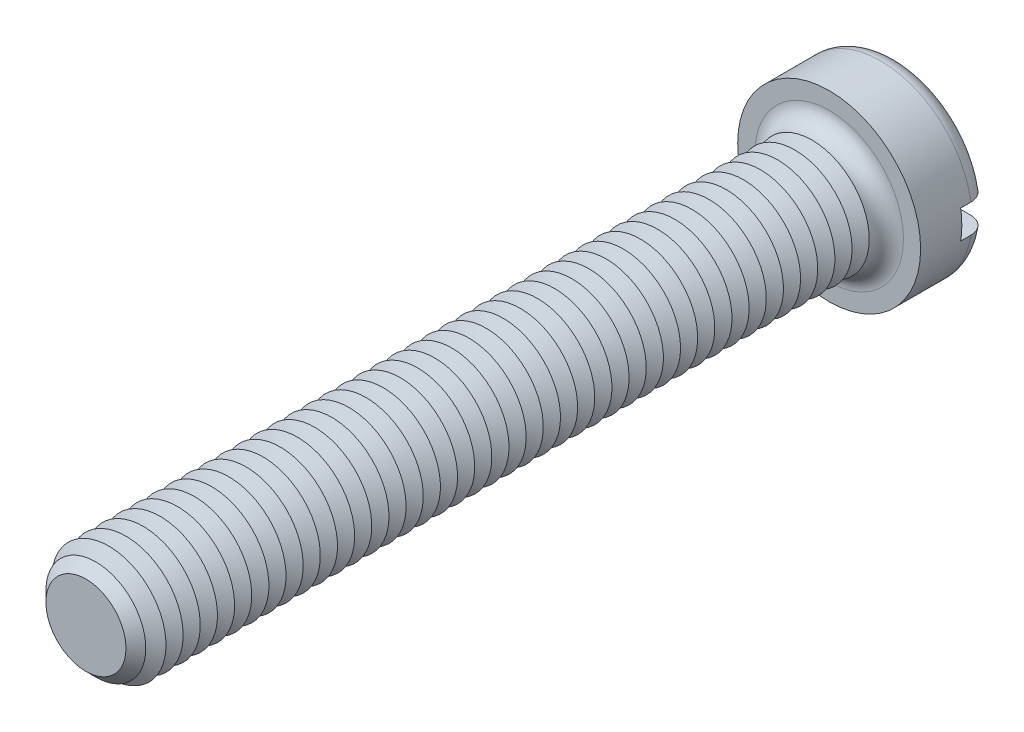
ISO-10303-21;
HEADER;
FILE_DESCRIPTION(('STEP AP214'),'2;1');
FILE_NAME('part.step','',(''),(''),'','','');
FILE_SCHEMA(('AUTOMOTIVE_DESIGN { 1 0 10303 214 1 1 1 1 }'));
ENDSEC;
DATA;
#1=APPLICATION_CONTEXT('core data for automotive mechanical design processes');
#2=APPLICATION_PROTOCOL_DEFINITION('international standard','automotive_design',2000,#1);
#3=PRODUCT_CONTEXT('',#1,'mechanical');
#4=PRODUCT('Part','Part','',(#3));
#5=PRODUCT_RELATED_PRODUCT_CATEGORY('part','',(#4));
#6=PRODUCT_DEFINITION_FORMATION('','',#4);
#7=PRODUCT_DEFINITION_CONTEXT('part definition',#1,'design');
#8=PRODUCT_DEFINITION('design','',#6,#7);
#9=PRODUCT_DEFINITION_SHAPE('','',#8);
#10=(LENGTH_UNIT() NAMED_UNIT(*) SI_UNIT(.MILLI.,.METRE.));
#11=(NAMED_UNIT(*) PLANE_ANGLE_UNIT() SI_UNIT($,.RADIAN.));
#12=(NAMED_UNIT(*) SI_UNIT($,.STERADIAN.) SOLID_ANGLE_UNIT());
#13=UNCERTAINTY_MEASURE_WITH_UNIT(LENGTH_MEASURE(1.E-05),#10,'distance_accuracy_value','');
#14=(GEOMETRIC_REPRESENTATION_CONTEXT(3) GLOBAL_UNCERTAINTY_ASSIGNED_CONTEXT((#13)) GLOBAL_UNIT_ASSIGNED_CONTEXT((#10,
#11,#12)) REPRESENTATION_CONTEXT('',''));
#15=CARTESIAN_POINT('',(0.,0.,0.));
#16=DIRECTION('',(0.,0.,1.));
#17=DIRECTION('',(1.,0.,0.));
#18=AXIS2_PLACEMENT_3D('',#15,#16,#17);
#19=CARTESIAN_POINT('',(0.,0.,-6.));
#20=DIRECTION('',(0.,0.,1.));
#21=DIRECTION('',(1.,0.,0.));
#22=AXIS2_PLACEMENT_3D('',#19,#20,#21);
#23=PLANE('',#22);
#24=CARTESIAN_POINT('',(0.,0.,-6.));
#25=DIRECTION('',(0.,0.,1.));
#26=DIRECTION('',(1.,0.,0.));
#27=AXIS2_PLACEMENT_3D('',#24,#25,#26);
#28=CIRCLE('',#27,6.5);
#29=CARTESIAN_POINT('',(-6.37867541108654,1.25,-6.));
#30=VERTEX_POINT('',#29);
#31=CARTESIAN_POINT('',(6.37867541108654,1.25,-6.));
#32=VERTEX_POINT('',#31);
#33=EDGE_CURVE('E116',#30,#32,#28,.F.);
#34=ORIENTED_EDGE('',*,*,#33,.T.);
#35=DIRECTION('',(1.,0.,0.));
#36=VECTOR('',#35,1.);
#37=CARTESIAN_POINT('',(-8.,1.25,-6.));
#38=LINE('',#37,#36);
#39=EDGE_CURVE('E111',#30,#32,#38,.T.);
#40=ORIENTED_EDGE('',*,*,#39,.F.);
#41=EDGE_LOOP('',(#34,#40));
#42=FACE_BOUND('',#41,.T.);
#43=ADVANCED_FACE('F39',(#42),#23,.F.);
#44=CARTESIAN_POINT('',(0.,0.,-4.5));
#45=DIRECTION('',(0.,0.,1.));
#46=DIRECTION('',(1.,0.,0.));
#47=AXIS2_PLACEMENT_3D('',#44,#45,#46);
#48=TOROIDAL_SURFACE('',#47,6.5,1.5);
#49=CARTESIAN_POINT('',(-7.63778128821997,1.25,-5.34492908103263));
#50=CARTESIAN_POINT('',(-7.58949199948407,1.25,-5.41482553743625));
#51=CARTESIAN_POINT('',(-7.53520056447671,1.25,-5.48065698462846));
#52=CARTESIAN_POINT('',(-7.41624971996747,1.25,-5.60228223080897));
#53=CARTESIAN_POINT('',(-7.35157642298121,1.25,-5.65806236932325));
#54=CARTESIAN_POINT('',(-7.21387612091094,1.25,-5.75795436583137));
#55=CARTESIAN_POINT('',(-7.14085828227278,1.25,-5.80207885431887));
#56=CARTESIAN_POINT('',(-6.98853766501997,1.25,-5.87758013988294));
#57=CARTESIAN_POINT('',(-6.90923642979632,1.25,-5.90896005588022));
#58=CARTESIAN_POINT('',(-6.74565677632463,1.25,-5.95849861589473));
#59=CARTESIAN_POINT('',(-6.66133328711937,1.25,-5.97650838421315));
#60=CARTESIAN_POINT('',(-6.49086565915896,1.25,-5.99833509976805));
#61=CARTESIAN_POINT('',(-6.40472129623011,1.25,-6.00215028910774));
#62=CARTESIAN_POINT('',(-6.23174891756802,1.25,-5.99550457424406));
#63=CARTESIAN_POINT('',(-6.14492874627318,1.25,-5.98483870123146));
#64=CARTESIAN_POINT('',(-5.97427268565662,1.25,-5.94920077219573));
#65=CARTESIAN_POINT('',(-5.89043699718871,1.25,-5.92422775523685));
#66=CARTESIAN_POINT('',(-5.72747580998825,1.25,-5.86041051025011));
#67=CARTESIAN_POINT('',(-5.64839123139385,1.25,-5.8214616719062));
#68=CARTESIAN_POINT('',(-5.49793182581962,1.25,-5.73076137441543));
#69=CARTESIAN_POINT('',(-5.42655700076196,1.25,-5.6790099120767));
#70=CARTESIAN_POINT('',(-5.29410028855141,1.25,-5.56444713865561));
#71=CARTESIAN_POINT('',(-5.23295591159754,1.25,-5.50170815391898));
#72=CARTESIAN_POINT('',(-5.12236155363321,1.25,-5.36664720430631));
#73=CARTESIAN_POINT('',(-5.07291010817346,1.25,-5.29432644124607));
#74=CARTESIAN_POINT('',(-4.98836421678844,1.25,-5.14389152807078));
#75=CARTESIAN_POINT('',(-4.95296843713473,1.25,-5.0659468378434));
#76=CARTESIAN_POINT('',(-4.89620356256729,1.25,-4.90510804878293));
#77=CARTESIAN_POINT('',(-4.87483169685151,1.25,-4.82221493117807));
#78=CARTESIAN_POINT('',(-4.8472995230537,1.25,-4.65636387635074));
#79=CARTESIAN_POINT('',(-4.84072446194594,1.25,-4.57347463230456));
#80=CARTESIAN_POINT('',(-4.84179430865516,1.25,-4.40779255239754));
#81=CARTESIAN_POINT('',(-4.84943782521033,1.25,-4.32499970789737));
#82=CARTESIAN_POINT('',(-4.87846819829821,1.25,-4.16301415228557));
#83=CARTESIAN_POINT('',(-4.89966978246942,1.25,-4.08378809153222));
#84=CARTESIAN_POINT('',(-4.95491528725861,1.25,-3.92995334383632));
#85=CARTESIAN_POINT('',(-4.98895983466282,1.25,-3.85534488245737));
#86=CARTESIAN_POINT('',(-5.06928242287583,1.25,-3.71183790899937));
#87=CARTESIAN_POINT('',(-5.11570495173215,1.25,-3.64302036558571));
#88=CARTESIAN_POINT('',(-5.21915370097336,1.25,-3.51388372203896));
#89=CARTESIAN_POINT('',(-5.27618132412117,1.25,-3.45356574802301));
#90=CARTESIAN_POINT('',(-5.40090076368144,1.25,-3.34137671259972));
#91=CARTESIAN_POINT('',(-5.46884305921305,1.25,-3.28978408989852));
#92=CARTESIAN_POINT('',(-5.61225757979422,1.25,-3.19841811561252));
#93=CARTESIAN_POINT('',(-5.68773079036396,1.25,-3.15864631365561));
#94=CARTESIAN_POINT('',(-5.84602026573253,1.25,-3.09111626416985));
#95=CARTESIAN_POINT('',(-5.92896901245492,1.25,-3.06366820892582));
#96=CARTESIAN_POINT('',(-6.09827849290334,1.25,-3.02294686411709));
#97=CARTESIAN_POINT('',(-6.18463944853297,1.25,-3.00967449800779));
#98=CARTESIAN_POINT('',(-6.35914138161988,1.25,-2.99765063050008));
#99=CARTESIAN_POINT('',(-6.4472913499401,1.25,-2.99902877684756));
#100=CARTESIAN_POINT('',(-6.62209547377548,1.25,-3.01665363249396));
#101=CARTESIAN_POINT('',(-6.70874965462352,1.25,-3.03290008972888));
#102=CARTESIAN_POINT('',(-6.87754008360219,1.25,-3.07975247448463));
#103=CARTESIAN_POINT('',(-6.95969991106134,1.25,-3.11027336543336));
#104=CARTESIAN_POINT('',(-7.11762200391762,1.25,-3.18486653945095));
#105=CARTESIAN_POINT('',(-7.19338469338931,1.25,-3.22893792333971));
#106=CARTESIAN_POINT('',(-7.33522754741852,1.25,-3.32873457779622));
#107=CARTESIAN_POINT('',(-7.40142768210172,1.25,-3.38428930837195));
#108=CARTESIAN_POINT('',(-7.52338344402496,1.25,-3.50587739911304));
#109=CARTESIAN_POINT('',(-7.5791399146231,1.25,-3.57190991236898));
#110=CARTESIAN_POINT('',(-7.67774856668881,1.25,-3.71151097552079));
#111=CARTESIAN_POINT('',(-7.72078137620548,1.25,-3.7849519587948));
#112=CARTESIAN_POINT('',(-7.79373860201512,1.25,-3.93807617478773));
#113=CARTESIAN_POINT('',(-7.82366445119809,1.25,-4.01775872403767));
#114=CARTESIAN_POINT('',(-7.86922494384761,1.25,-4.1801114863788));
#115=CARTESIAN_POINT('',(-7.88502105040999,1.25,-4.26273642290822));
#116=CARTESIAN_POINT('',(-7.90243332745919,1.25,-4.42948977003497));
#117=CARTESIAN_POINT('',(-7.90404643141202,1.25,-4.51361850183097));
#118=CARTESIAN_POINT('',(-7.89306914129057,1.25,-4.68049925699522));
#119=CARTESIAN_POINT('',(-7.88055163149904,1.25,-4.76325613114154));
#120=CARTESIAN_POINT('',(-7.84181179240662,1.25,-4.92542124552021));
#121=CARTESIAN_POINT('',(-7.81560657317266,1.25,-5.00483353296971));
#122=CARTESIAN_POINT('',(-7.76329893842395,1.25,-5.12766777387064));
#123=CARTESIAN_POINT('',(-7.74127773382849,1.25,-5.17287245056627));
#124=CARTESIAN_POINT('',(-7.69279783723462,1.25,-5.26083500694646));
#125=CARTESIAN_POINT('',(-7.66633917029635,1.25,-5.30359290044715));
#126=CARTESIAN_POINT('',(-7.63778128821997,1.25,-5.34492908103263));
#127=B_SPLINE_CURVE_WITH_KNOTS('',3,(#49,#50,#51,#52,#53,#54,#55,#56,#57,#58,#59,#60,#61,#62,
#63,#64,#65,#66,#67,#68,#69,#70,#71,#72,#73,#74,#75,#76,#77,#78,#79,#80,#81,#82,#83,#84,#85,#86,
#87,#88,#89,#90,#91,#92,#93,#94,#95,#96,#97,#98,#99,#100,#101,#102,#103,#104,#105,#106,#107,
#108,#109,#110,#111,#112,#113,#114,#115,#116,#117,#118,#119,#120,#121,#122,#123,#124,#125,#126),
.UNSPECIFIED.,.T.,.F.,(4,2,2,2,2,2,2,2,2,2,2,2,2,2,2,2,2,2,2,2,2,2,2,2,2,2,2,2,2,2,2,2,2,2,2,2,
2,2,4),(0.,0.254678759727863,0.509701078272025,0.764445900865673,1.01912834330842,
1.27660578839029,1.53411511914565,1.7953075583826,2.05651754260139,2.31972495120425,
2.58293242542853,2.84446831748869,3.10597143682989,3.36151874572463,3.61701554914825,
3.86525656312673,4.11347328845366,4.35836855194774,4.60327576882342,4.8511774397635,
5.0991119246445,5.35387584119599,5.60867314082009,5.86956650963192,6.13047687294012,
6.39369803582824,6.65691473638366,6.91858297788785,7.18023385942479,7.43824706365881,
7.69623942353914,7.95037087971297,8.20447454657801,8.45563599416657,8.70685174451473,
8.95677764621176,9.20639187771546,9.35700761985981,9.50762251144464),.UNSPECIFIED.);
#128=CARTESIAN_POINT('',(-7.90174031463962,1.25,-4.50000000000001));
#129=VERTEX_POINT('',#128);
#130=EDGE_CURVE('E521',#129,#30,#127,.T.);
#131=ORIENTED_EDGE('',*,*,#130,.F.);
#132=CARTESIAN_POINT('',(0.,0.,-4.5));
#133=DIRECTION('',(0.,0.,1.));
#134=DIRECTION('',(1.,0.,0.));
#135=AXIS2_PLACEMENT_3D('',#132,#133,#134);
#136=CIRCLE('',#135,8.);
#137=CARTESIAN_POINT('',(7.90174031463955,1.25,-4.5));
#138=VERTEX_POINT('',#137);
#139=EDGE_CURVE('E125',#138,#129,#136,.T.);
#140=ORIENTED_EDGE('',*,*,#139,.F.);
#141=CARTESIAN_POINT('',(4.95236709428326,1.25,-5.05808354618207));
#142=CARTESIAN_POINT('',(4.98477386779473,1.25,-5.13646278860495));
#143=CARTESIAN_POINT('',(5.02397623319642,1.25,-5.21210974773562));
#144=CARTESIAN_POINT('',(5.11464829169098,1.25,-5.35575180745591));
#145=CARTESIAN_POINT('',(5.16613670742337,1.25,-5.42373499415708));
#146=CARTESIAN_POINT('',(5.27963080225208,1.25,-5.55005899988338));
#147=CARTESIAN_POINT('',(5.34161871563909,1.25,-5.60841578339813));
#148=CARTESIAN_POINT('',(5.47431803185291,1.25,-5.71412381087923));
#149=CARTESIAN_POINT('',(5.545027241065,1.25,-5.76147781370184));
#150=CARTESIAN_POINT('',(5.69469818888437,1.25,-5.84486022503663));
#151=CARTESIAN_POINT('',(5.77379661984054,1.25,-5.88064336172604));
#152=CARTESIAN_POINT('',(5.93682776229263,1.25,-5.93863952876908));
#153=CARTESIAN_POINT('',(6.02076112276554,1.25,-5.96085073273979));
#154=CARTESIAN_POINT('',(6.19235911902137,1.25,-5.99130732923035));
#155=CARTESIAN_POINT('',(6.2800597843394,1.25,-5.99935025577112));
#156=CARTESIAN_POINT('',(6.45556807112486,1.25,-6.00057400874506));
#157=CARTESIAN_POINT('',(6.54337569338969,1.25,-5.99375472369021));
#158=CARTESIAN_POINT('',(6.71642471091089,1.25,-5.96539034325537));
#159=CARTESIAN_POINT('',(6.8016703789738,1.25,-5.94387137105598));
#160=CARTESIAN_POINT('',(6.96726399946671,1.25,-5.8866508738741));
#161=CARTESIAN_POINT('',(7.04761223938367,1.25,-5.85095018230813));
#162=CARTESIAN_POINT('',(7.2000703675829,1.25,-5.7668235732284));
#163=CARTESIAN_POINT('',(7.27226868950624,1.25,-5.71855796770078));
#164=CARTESIAN_POINT('',(7.40737382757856,1.25,-5.61041520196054));
#165=CARTESIAN_POINT('',(7.47028138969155,1.25,-5.55053897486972));
#166=CARTESIAN_POINT('',(7.5840004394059,1.25,-5.42185995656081));
#167=CARTESIAN_POINT('',(7.63498189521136,1.25,-5.35320736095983));
#168=CARTESIAN_POINT('',(7.72451646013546,1.25,-5.20822613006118));
#169=CARTESIAN_POINT('',(7.76307051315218,1.25,-5.13189807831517));
#170=CARTESIAN_POINT('',(7.82615156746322,1.25,-4.97479919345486));
#171=CARTESIAN_POINT('',(7.85085353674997,1.25,-4.89409858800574));
#172=CARTESIAN_POINT('',(7.88624162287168,1.25,-4.72968126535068));
#173=CARTESIAN_POINT('',(7.89692844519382,1.25,-4.64596470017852));
#174=CARTESIAN_POINT('',(7.90393395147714,1.25,-4.47857496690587));
#175=CARTESIAN_POINT('',(7.900361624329,1.25,-4.39490633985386));
#176=CARTESIAN_POINT('',(7.8792027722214,1.25,-4.22936201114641));
#177=CARTESIAN_POINT('',(7.86161649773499,1.25,-4.14748627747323));
#178=CARTESIAN_POINT('',(7.81298565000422,1.25,-3.98793539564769));
#179=CARTESIAN_POINT('',(7.78195585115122,1.25,-3.91025574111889));
#180=CARTESIAN_POINT('',(7.70736418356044,1.25,-3.76116938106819));
#181=CARTESIAN_POINT('',(7.66380211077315,1.25,-3.68976277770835));
#182=CARTESIAN_POINT('',(7.56515173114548,1.25,-3.55480889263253));
#183=CARTESIAN_POINT('',(7.51000119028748,1.25,-3.49130712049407));
#184=CARTESIAN_POINT('',(7.38992820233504,1.25,-3.3743390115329));
#185=CARTESIAN_POINT('',(7.32500529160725,1.25,-3.32087315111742));
#186=CARTESIAN_POINT('',(7.18646521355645,1.25,-3.22483712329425));
#187=CARTESIAN_POINT('',(7.11275872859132,1.25,-3.18239583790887));
#188=CARTESIAN_POINT('',(6.95934489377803,1.25,-3.11028530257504));
#189=CARTESIAN_POINT('',(6.87963710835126,1.25,-3.08061698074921));
#190=CARTESIAN_POINT('',(6.71523243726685,1.25,-3.03442872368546));
#191=CARTESIAN_POINT('',(6.63047940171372,1.25,-3.0181086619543));
#192=CARTESIAN_POINT('',(6.45944163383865,1.25,-2.99971307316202));
#193=CARTESIAN_POINT('',(6.37315677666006,1.25,-2.99763871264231));
#194=CARTESIAN_POINT('',(6.20021063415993,1.25,-3.00779604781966));
#195=CARTESIAN_POINT('',(6.11356117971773,1.25,-3.02022976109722));
#196=CARTESIAN_POINT('',(5.94354092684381,1.25,-3.05935975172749));
#197=CARTESIAN_POINT('',(5.86017035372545,1.25,-3.08605700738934));
#198=CARTESIAN_POINT('',(5.69848536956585,1.25,-3.15322746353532));
#199=CARTESIAN_POINT('',(5.62021039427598,1.25,-3.1937956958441));
#200=CARTESIAN_POINT('',(5.47164170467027,1.25,-3.28758816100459));
#201=CARTESIAN_POINT('',(5.40134797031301,1.25,-3.3408123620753));
#202=CARTESIAN_POINT('',(5.27136483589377,1.25,-3.45806317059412));
#203=CARTESIAN_POINT('',(5.21160120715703,1.25,-3.52200740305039));
#204=CARTESIAN_POINT('',(5.10396941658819,1.25,-3.65922833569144));
#205=CARTESIAN_POINT('',(5.05609917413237,1.25,-3.73250340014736));
#206=CARTESIAN_POINT('',(4.97487058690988,1.25,-3.8844714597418));
#207=CARTESIAN_POINT('',(4.94119529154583,1.25,-3.96299495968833));
#208=CARTESIAN_POINT('',(4.88793322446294,1.25,-4.12470694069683));
#209=CARTESIAN_POINT('',(4.86834741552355,1.25,-4.20789574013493));
#210=CARTESIAN_POINT('',(4.84433446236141,1.25,-4.3740749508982));
#211=CARTESIAN_POINT('',(4.83950391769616,1.25,-4.45700748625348));
#212=CARTESIAN_POINT('',(4.84404021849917,1.25,-4.62240731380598));
#213=CARTESIAN_POINT('',(4.85338770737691,1.25,-4.70487508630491));
#214=CARTESIAN_POINT('',(4.87895619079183,1.25,-4.83246978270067));
#215=CARTESIAN_POINT('',(4.89056704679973,1.25,-4.87856970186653));
#216=CARTESIAN_POINT('',(4.91819711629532,1.25,-4.96942661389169));
#217=CARTESIAN_POINT('',(4.93421619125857,1.25,-5.01418364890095));
#218=CARTESIAN_POINT('',(4.95236709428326,1.25,-5.05808354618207));
#219=B_SPLINE_CURVE_WITH_KNOTS('',3,(#141,#142,#143,#144,#145,#146,#147,#148,#149,#150,#151,
#152,#153,#154,#155,#156,#157,#158,#159,#160,#161,#162,#163,#164,#165,#166,#167,#168,#169,#170,
#171,#172,#173,#174,#175,#176,#177,#178,#179,#180,#181,#182,#183,#184,#185,#186,#187,#188,#189,
#190,#191,#192,#193,#194,#195,#196,#197,#198,#199,#200,#201,#202,#203,#204,#205,#206,#207,#208,
#209,#210,#211,#212,#213,#214,#215,#216,#217,#218),.UNSPECIFIED.,.T.,.F.,(4,2,2,2,2,2,2,2,2,2,2,
2,2,2,2,2,2,2,2,2,2,2,2,2,2,2,2,2,2,2,2,2,2,2,2,2,2,2,4),(0.,0.25426396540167,0.508917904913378,
0.763145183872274,1.01730864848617,1.27655188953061,1.53583000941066,1.79878406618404,
2.06174009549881,2.32423003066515,2.5867045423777,2.84598168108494,3.10523799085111,
3.36053725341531,3.61581712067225,3.8677953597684,4.11976091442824,4.36980428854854,
4.61984319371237,4.86960800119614,5.11937687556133,5.37052303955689,5.62168112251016,
5.87565515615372,6.12964764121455,6.38737709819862,6.64512765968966,6.90651052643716,
7.16791132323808,7.43114013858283,7.69436829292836,7.95565940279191,8.21690477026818,
8.47196060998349,8.72703387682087,8.97506819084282,9.22276418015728,9.36518087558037,
9.50759309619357),.UNSPECIFIED.);
#220=EDGE_CURVE('E523',#32,#138,#219,.T.);
#221=ORIENTED_EDGE('',*,*,#220,.F.);
#222=ORIENTED_EDGE('',*,*,#33,.F.);
#223=EDGE_LOOP('',(#131,#140,#221,#222));
#224=FACE_BOUND('',#223,.T.);
#225=ADVANCED_FACE('F505',(#224),#48,.T.);
#226=CARTESIAN_POINT('',(0.,0.,-6.));
#227=DIRECTION('',(0.,0.,1.));
#228=DIRECTION('',(1.,0.,0.));
#229=AXIS2_PLACEMENT_3D('',#226,#227,#228);
#230=CYLINDRICAL_SURFACE('',#229,8.);
#231=DIRECTION('',(0.,0.,1.));
#232=VECTOR('',#231,1.);
#233=CARTESIAN_POINT('',(7.90174031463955,1.25,-6.));
#234=LINE('',#233,#232);
#235=CARTESIAN_POINT('',(7.90174031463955,1.25,-3.6));
#236=VERTEX_POINT('',#235);
#237=EDGE_CURVE('E536',#138,#236,#234,.T.);
#238=ORIENTED_EDGE('',*,*,#237,.F.);
#239=ORIENTED_EDGE('',*,*,#139,.T.);
#240=DIRECTION('',(0.,0.,1.));
#241=VECTOR('',#240,1.);
#242=CARTESIAN_POINT('',(-7.90174031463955,1.25,-6.));
#243=LINE('',#242,#241);
#244=CARTESIAN_POINT('',(-7.90174031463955,1.25,-3.6));
#245=VERTEX_POINT('',#244);
#246=EDGE_CURVE('E63',#245,#129,#243,.F.);
#247=ORIENTED_EDGE('',*,*,#246,.F.);
#248=CARTESIAN_POINT('',(0.,0.,-3.6));
#249=DIRECTION('',(0.,0.,-1.));
#250=DIRECTION('',(-1.,0.,0.));
#251=AXIS2_PLACEMENT_3D('',#248,#249,#250);
#252=CIRCLE('',#251,8.);
#253=CARTESIAN_POINT('',(-7.90174031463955,-1.25,-3.6));
#254=VERTEX_POINT('',#253);
#255=EDGE_CURVE('E43',#245,#254,#252,.F.);
#256=ORIENTED_EDGE('',*,*,#255,.T.);
#257=DIRECTION('',(0.,0.,1.));
#258=VECTOR('',#257,1.);
#259=CARTESIAN_POINT('',(-7.90174031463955,-1.25,-6.));
#260=LINE('',#259,#258);
#261=CARTESIAN_POINT('',(-7.9017403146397,-1.25,-4.49999999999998));
#262=VERTEX_POINT('',#261);
#263=EDGE_CURVE('E533',#262,#254,#260,.T.);
#264=ORIENTED_EDGE('',*,*,#263,.F.);
#265=CARTESIAN_POINT('',(7.90174031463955,-1.25,-4.5));
#266=VERTEX_POINT('',#265);
#267=EDGE_CURVE('E127',#262,#266,#136,.T.);
#268=ORIENTED_EDGE('',*,*,#267,.T.);
#269=DIRECTION('',(0.,0.,1.));
#270=VECTOR('',#269,1.);
#271=CARTESIAN_POINT('',(7.90174031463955,-1.25,-6.));
#272=LINE('',#271,#270);
#273=CARTESIAN_POINT('',(7.90174031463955,-1.25,-3.6));
#274=VERTEX_POINT('',#273);
#275=EDGE_CURVE('E55',#274,#266,#272,.F.);
#276=ORIENTED_EDGE('',*,*,#275,.F.);
#277=EDGE_CURVE('E11',#274,#236,#252,.F.);
#278=ORIENTED_EDGE('',*,*,#277,.T.);
#279=EDGE_LOOP('',(#238,#239,#247,#256,#264,#268,#276,#278));
#280=FACE_BOUND('',#279,.T.);
#281=CARTESIAN_POINT('',(0.,0.,0.));
#282=DIRECTION('',(0.,0.,1.));
#283=DIRECTION('',(1.,0.,0.));
#284=AXIS2_PLACEMENT_3D('',#281,#282,#283);
#285=CIRCLE('',#284,8.);
#286=CARTESIAN_POINT('',(8.,0.,0.));
#287=VERTEX_POINT('',#286);
#288=EDGE_CURVE('E539',#287,#287,#285,.T.);
#289=ORIENTED_EDGE('',*,*,#288,.F.);
#290=EDGE_LOOP('',(#289));
#291=FACE_BOUND('',#290,.T.);
#292=ADVANCED_FACE('F501',(#280,#291),#230,.T.);
#293=CARTESIAN_POINT('',(6.37867541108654,-1.25,-6.));
#294=VERTEX_POINT('',#293);
#295=CARTESIAN_POINT('',(-6.37867541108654,-1.25,-6.));
#296=VERTEX_POINT('',#295);
#297=EDGE_CURVE('E109',#294,#296,#28,.F.);
#298=ORIENTED_EDGE('',*,*,#297,.T.);
#299=DIRECTION('',(-1.,0.,0.));
#300=VECTOR('',#299,1.);
#301=CARTESIAN_POINT('',(-8.,-1.25,-6.));
#302=LINE('',#301,#300);
#303=EDGE_CURVE('E96',#294,#296,#302,.T.);
#304=ORIENTED_EDGE('',*,*,#303,.F.);
#305=EDGE_LOOP('',(#298,#304));
#306=FACE_BOUND('',#305,.T.);
#307=ADVANCED_FACE('F108',(#306),#23,.F.);
#308=CARTESIAN_POINT('',(0.,0.,0.));
#309=DIRECTION('',(0.,0.,1.));
#310=DIRECTION('',(1.,0.,0.));
#311=AXIS2_PLACEMENT_3D('',#308,#309,#310);
#312=PLANE('',#311);
#313=CARTESIAN_POINT('',(0.,0.,0.));
#314=DIRECTION('',(0.,0.,1.));
#315=DIRECTION('',(1.,0.,0.));
#316=AXIS2_PLACEMENT_3D('',#313,#314,#315);
#317=CIRCLE('',#316,6.5);
#318=CARTESIAN_POINT('',(6.5,0.,0.));
#319=VERTEX_POINT('',#318);
#320=EDGE_CURVE('E115',#319,#319,#317,.F.);
#321=ORIENTED_EDGE('',*,*,#320,.T.);
#322=EDGE_LOOP('',(#321));
#323=FACE_BOUND('',#322,.T.);
#324=ORIENTED_EDGE('',*,*,#288,.T.);
#325=EDGE_LOOP('',(#324));
#326=FACE_BOUND('',#325,.T.);
#327=ADVANCED_FACE('F500',(#323,#326),#312,.T.);
#328=CARTESIAN_POINT('',(-7.63778128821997,-1.25,-5.34492908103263));
#329=CARTESIAN_POINT('',(-7.68527581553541,-1.25,-5.27616964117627));
#330=CARTESIAN_POINT('',(-7.72703224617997,-1.25,-5.20337764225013));
#331=CARTESIAN_POINT('',(-7.79778035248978,-1.25,-5.05176511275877));
#332=CARTESIAN_POINT('',(-7.82675823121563,-1.25,-4.97293817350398));
#333=CARTESIAN_POINT('',(-7.87103239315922,-1.25,-4.81153865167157));
#334=CARTESIAN_POINT('',(-7.8863313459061,-1.25,-4.72896680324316));
#335=CARTESIAN_POINT('',(-7.90278562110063,-1.25,-4.56244566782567));
#336=CARTESIAN_POINT('',(-7.90394420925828,-1.25,-4.4784967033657));
#337=CARTESIAN_POINT('',(-7.89211470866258,-1.25,-4.31190980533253));
#338=CARTESIAN_POINT('',(-7.87917806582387,-1.25,-4.22926821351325));
#339=CARTESIAN_POINT('',(-7.8396278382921,-1.25,-4.06732477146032));
#340=CARTESIAN_POINT('',(-7.81301388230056,-1.25,-3.98802301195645));
#341=CARTESIAN_POINT('',(-7.74686575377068,-1.25,-3.83490116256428));
#342=CARTESIAN_POINT('',(-7.70731700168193,-1.25,-3.76108737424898));
#343=CARTESIAN_POINT('',(-7.61647675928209,-1.25,-3.62108231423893));
#344=CARTESIAN_POINT('',(-7.56518496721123,-1.25,-3.55489123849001));
#345=CARTESIAN_POINT('',(-7.45192141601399,-1.25,-3.43145488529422));
#346=CARTESIAN_POINT('',(-7.3898717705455,-1.25,-3.37428109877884));
#347=CARTESIAN_POINT('',(-7.25715883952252,-1.25,-3.27100737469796));
#348=CARTESIAN_POINT('',(-7.18649507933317,-1.25,-3.22490804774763));
#349=CARTESIAN_POINT('',(-7.03760898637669,-1.25,-3.14445316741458));
#350=CARTESIAN_POINT('',(-6.95930204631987,-1.25,-3.1102542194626));
#351=CARTESIAN_POINT('',(-6.79811453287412,-1.25,-3.05526915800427));
#352=CARTESIAN_POINT('',(-6.71523359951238,-1.25,-3.03448410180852));
#353=CARTESIAN_POINT('',(-6.5459165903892,-1.25,-3.006592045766));
#354=CARTESIAN_POINT('',(-6.45944575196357,-1.25,-2.99969602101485));
#355=CARTESIAN_POINT('',(-6.28655568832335,-1.25,-3.00032465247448));
#356=CARTESIAN_POINT('',(-6.20013646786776,-1.25,-3.00785047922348));
#357=CARTESIAN_POINT('',(-6.02865505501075,-1.25,-3.03725742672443));
#358=CARTESIAN_POINT('',(-5.94362352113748,-1.25,-3.05931758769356));
#359=CARTESIAN_POINT('',(-5.77844448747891,-1.25,-3.11735373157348));
#360=CARTESIAN_POINT('',(-5.69829723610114,-1.25,-3.15333042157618));
#361=CARTESIAN_POINT('',(-5.54495924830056,-1.25,-3.23837037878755));
#362=CARTESIAN_POINT('',(-5.47178958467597,-1.25,-3.28747168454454));
#363=CARTESIAN_POINT('',(-5.33486536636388,-1.25,-3.39741183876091));
#364=CARTESIAN_POINT('',(-5.27111040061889,-1.25,-3.45825017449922));
#365=CARTESIAN_POINT('',(-5.15579778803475,-1.25,-3.58914722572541));
#366=CARTESIAN_POINT('',(-5.10409113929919,-1.25,-3.65907455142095));
#367=CARTESIAN_POINT('',(-5.01353659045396,-1.25,-3.8068142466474));
#368=CARTESIAN_POINT('',(-4.97468647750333,-1.25,-3.88462525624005));
#369=CARTESIAN_POINT('',(-4.91208858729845,-1.25,-4.04366636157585));
#370=CARTESIAN_POINT('',(-4.88795969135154,-1.25,-4.12474643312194));
#371=CARTESIAN_POINT('',(-4.85404909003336,-1.25,-4.28985038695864));
#372=CARTESIAN_POINT('',(-4.84426486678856,-1.25,-4.37387374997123));
#373=CARTESIAN_POINT('',(-4.83946276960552,-1.25,-4.54023897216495));
#374=CARTESIAN_POINT('',(-4.8440833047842,-1.25,-4.62257060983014));
#375=CARTESIAN_POINT('',(-4.86713763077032,-1.25,-4.78527148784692));
#376=CARTESIAN_POINT('',(-4.88557092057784,-1.25,-4.86564079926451));
#377=CARTESIAN_POINT('',(-4.9355229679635,-1.25,-5.02189555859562));
#378=CARTESIAN_POINT('',(-4.9669975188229,-1.25,-5.09779517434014));
#379=CARTESIAN_POINT('',(-5.04199393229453,-1.25,-5.24338322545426));
#380=CARTESIAN_POINT('',(-5.0855168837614,-1.25,-5.31307109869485));
#381=CARTESIAN_POINT('',(-5.18427540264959,-1.25,-5.44580979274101));
#382=CARTESIAN_POINT('',(-5.2397318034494,-1.25,-5.50869620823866));
#383=CARTESIAN_POINT('',(-5.36015301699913,-1.25,-5.62458635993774));
#384=CARTESIAN_POINT('',(-5.42511919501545,-1.25,-5.67758867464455));
#385=CARTESIAN_POINT('',(-5.56469412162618,-1.25,-5.7737610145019));
#386=CARTESIAN_POINT('',(-5.6395232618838,-1.25,-5.81661133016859));
#387=CARTESIAN_POINT('',(-5.79521544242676,-1.25,-5.8894110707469));
#388=CARTESIAN_POINT('',(-5.8760791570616,-1.25,-5.91935905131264));
#389=CARTESIAN_POINT('',(-6.04317815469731,-1.25,-5.9660059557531));
#390=CARTESIAN_POINT('',(-6.12948555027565,-1.25,-5.98244700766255));
#391=CARTESIAN_POINT('',(-6.30363462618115,-1.25,-6.00064866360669));
#392=CARTESIAN_POINT('',(-6.39147629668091,-1.25,-6.00240936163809));
#393=CARTESIAN_POINT('',(-6.5664192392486,-1.25,-5.9911248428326));
#394=CARTESIAN_POINT('',(-6.653518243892,-1.25,-5.9780442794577));
#395=CARTESIAN_POINT('',(-6.82426167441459,-1.25,-5.93729204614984));
#396=CARTESIAN_POINT('',(-6.90790538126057,-1.25,-5.90961735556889));
#397=CARTESIAN_POINT('',(-7.06846412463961,-1.25,-5.84071272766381));
#398=CARTESIAN_POINT('',(-7.14543542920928,-1.25,-5.79961377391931));
#399=CARTESIAN_POINT('',(-7.29116896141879,-1.25,-5.70491210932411));
#400=CARTESIAN_POINT('',(-7.35994165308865,-1.25,-5.65132560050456));
#401=CARTESIAN_POINT('',(-7.46362894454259,-1.25,-5.55509815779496));
#402=CARTESIAN_POINT('',(-7.50165191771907,-1.25,-5.51575032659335));
#403=CARTESIAN_POINT('',(-7.57319530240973,-1.25,-5.43315308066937));
#404=CARTESIAN_POINT('',(-7.60671575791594,-1.25,-5.38990370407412));
#405=CARTESIAN_POINT('',(-7.63778128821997,-1.25,-5.34492908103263));
#406=B_SPLINE_CURVE_WITH_KNOTS('',3,(#328,#329,#330,#331,#332,#333,#334,#335,#336,#337,#338,
#339,#340,#341,#342,#343,#344,#345,#346,#347,#348,#349,#350,#351,#352,#353,#354,#355,#356,#357,
#358,#359,#360,#361,#362,#363,#364,#365,#366,#367,#368,#369,#370,#371,#372,#373,#374,#375,#376,
#377,#378,#379,#380,#381,#382,#383,#384,#385,#386,#387,#388,#389,#390,#391,#392,#393,#394,#395,
#396,#397,#398,#399,#400,#401,#402,#403,#404,#405),.UNSPECIFIED.,.T.,.F.,(4,2,2,2,2,2,2,2,2,2,2,
2,2,2,2,2,2,2,2,2,2,2,2,2,2,2,2,2,2,2,2,2,2,2,2,2,2,2,4),(0.,0.250506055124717,
0.501281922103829,0.752008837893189,1.00267784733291,1.25243500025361,1.50219893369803,
1.75224536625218,2.00229822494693,2.25424343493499,2.50620253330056,2.76136198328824,
3.01654154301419,3.27556891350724,3.53461730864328,3.79691797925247,4.05923197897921,
4.32231463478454,4.5853858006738,4.84500678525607,5.10458306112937,5.3571172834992,
5.60960717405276,5.85581050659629,6.10200490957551,6.34737151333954,6.59276029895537,
6.84315522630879,7.09358613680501,7.35108485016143,7.60861238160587,7.87094926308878,
8.13328446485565,8.39624576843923,8.65926152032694,8.91978401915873,9.17997036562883,
9.34382460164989,9.50767723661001),.UNSPECIFIED.);
#407=EDGE_CURVE('E103',#296,#262,#406,.T.);
#408=ORIENTED_EDGE('',*,*,#407,.F.);
#409=ORIENTED_EDGE('',*,*,#297,.F.);
#410=CARTESIAN_POINT('',(4.95236709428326,-1.25,-5.05808354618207));
#411=CARTESIAN_POINT('',(4.92105512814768,-1.25,-4.98233216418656));
#412=CARTESIAN_POINT('',(4.89604361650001,-1.25,-4.90392040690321));
#413=CARTESIAN_POINT('',(4.85951223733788,-1.25,-4.74395758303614));
#414=CARTESIAN_POINT('',(4.8480045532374,-1.25,-4.66240375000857));
#415=CARTESIAN_POINT('',(4.83891469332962,-1.25,-4.49852199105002));
#416=CARTESIAN_POINT('',(4.84133145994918,-1.25,-4.41619412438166));
#417=CARTESIAN_POINT('',(4.8600038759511,-1.25,-4.25314313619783));
#418=CARTESIAN_POINT('',(4.87625705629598,-1.25,-4.17241973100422));
#419=CARTESIAN_POINT('',(4.92196554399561,-1.25,-4.01505032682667));
#420=CARTESIAN_POINT('',(4.95138456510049,-1.25,-3.93839376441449));
#421=CARTESIAN_POINT('',(5.02244158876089,-1.25,-3.79097367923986));
#422=CARTESIAN_POINT('',(5.06408092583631,-1.25,-3.72021080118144));
#423=CARTESIAN_POINT('',(5.15918188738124,-1.25,-3.5851203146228));
#424=CARTESIAN_POINT('',(5.21285223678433,-1.25,-3.5209397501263));
#425=CARTESIAN_POINT('',(5.32993512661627,-1.25,-3.40218700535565));
#426=CARTESIAN_POINT('',(5.39334903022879,-1.25,-3.34761617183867));
#427=CARTESIAN_POINT('',(5.5300552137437,-1.25,-3.24801679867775));
#428=CARTESIAN_POINT('',(5.60357647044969,-1.25,-3.20330242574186));
#429=CARTESIAN_POINT('',(5.75697062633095,-1.25,-3.1265687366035));
#430=CARTESIAN_POINT('',(5.83684424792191,-1.25,-3.09455086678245));
#431=CARTESIAN_POINT('',(6.00239031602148,-1.25,-3.04353393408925));
#432=CARTESIAN_POINT('',(6.08814636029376,-1.25,-3.02480570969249));
#433=CARTESIAN_POINT('',(6.26158564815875,-1.25,-3.00194915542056));
#434=CARTESIAN_POINT('',(6.34926896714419,-1.25,-2.997821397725));
#435=CARTESIAN_POINT('',(6.52441816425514,-1.25,-3.00435236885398));
#436=CARTESIAN_POINT('',(6.61188199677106,-1.25,-3.01506655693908));
#437=CARTESIAN_POINT('',(6.78373130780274,-1.25,-3.05116556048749));
#438=CARTESIAN_POINT('',(6.8681168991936,-1.25,-3.07654983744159));
#439=CARTESIAN_POINT('',(7.03056473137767,-1.25,-3.14105639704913));
#440=CARTESIAN_POINT('',(7.10867812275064,-1.25,-3.18004978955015));
#441=CARTESIAN_POINT('',(7.25711285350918,-1.25,-3.27078804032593));
#442=CARTESIAN_POINT('',(7.327434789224,-1.25,-3.32253192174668));
#443=CARTESIAN_POINT('',(7.45716954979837,-1.25,-3.4364775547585));
#444=CARTESIAN_POINT('',(7.51672925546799,-1.25,-3.49851206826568));
#445=CARTESIAN_POINT('',(7.62440498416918,-1.25,-3.63182557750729));
#446=CARTESIAN_POINT('',(7.67252193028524,-1.25,-3.70310382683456));
#447=CARTESIAN_POINT('',(7.75523498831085,-1.25,-3.8517825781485));
#448=CARTESIAN_POINT('',(7.79001407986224,-1.25,-3.92908131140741));
#449=CARTESIAN_POINT('',(7.84595474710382,-1.25,-4.08845836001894));
#450=CARTESIAN_POINT('',(7.86711715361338,-1.25,-4.1705363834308));
#451=CARTESIAN_POINT('',(7.89503817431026,-1.25,-4.3362768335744));
#452=CARTESIAN_POINT('',(7.90193595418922,-1.25,-4.41991584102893));
#453=CARTESIAN_POINT('',(7.90153623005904,-1.25,-4.58715860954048));
#454=CARTESIAN_POINT('',(7.89423915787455,-1.25,-4.67076237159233));
#455=CARTESIAN_POINT('',(7.86572271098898,-1.25,-4.83525080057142));
#456=CARTESIAN_POINT('',(7.84455307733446,-1.25,-4.91614410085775));
#457=CARTESIAN_POINT('',(7.78897430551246,-1.25,-5.0732444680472));
#458=CARTESIAN_POINT('',(7.75456511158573,-1.25,-5.1494515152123));
#459=CARTESIAN_POINT('',(7.67339923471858,-1.25,-5.29528903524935));
#460=CARTESIAN_POINT('',(7.62660424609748,-1.25,-5.36489817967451));
#461=CARTESIAN_POINT('',(7.52209201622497,-1.25,-5.49536318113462));
#462=CARTESIAN_POINT('',(7.4643743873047,-1.25,-5.55621872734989));
#463=CARTESIAN_POINT('',(7.33909994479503,-1.25,-5.66807257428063));
#464=CARTESIAN_POINT('',(7.27145672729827,-1.25,-5.71897407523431));
#465=CARTESIAN_POINT('',(7.12868060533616,-1.25,-5.80887807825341));
#466=CARTESIAN_POINT('',(7.0535472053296,-1.25,-5.84787979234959));
#467=CARTESIAN_POINT('',(6.89682225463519,-1.25,-5.91345911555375));
#468=CARTESIAN_POINT('',(6.81515596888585,-1.25,-5.93985808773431));
#469=CARTESIAN_POINT('',(6.64858434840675,-1.25,-5.97879449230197));
#470=CARTESIAN_POINT('',(6.56367874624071,-1.25,-5.99133077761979));
#471=CARTESIAN_POINT('',(6.39168259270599,-1.25,-6.00236627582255));
#472=CARTESIAN_POINT('',(6.30457835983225,-1.25,-6.00065255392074));
#473=CARTESIAN_POINT('',(6.13186422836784,-1.25,-5.98278857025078));
#474=CARTESIAN_POINT('',(6.04625438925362,-1.25,-5.96663773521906));
#475=CARTESIAN_POINT('',(5.87802521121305,-1.25,-5.92012173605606));
#476=CARTESIAN_POINT('',(5.79544617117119,-1.25,-5.88961066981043));
#477=CARTESIAN_POINT('',(5.63656223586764,-1.25,-5.81513349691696));
#478=CARTESIAN_POINT('',(5.56025908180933,-1.25,-5.77116367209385));
#479=CARTESIAN_POINT('',(5.4162607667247,-1.25,-5.67098882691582));
#480=CARTESIAN_POINT('',(5.34855795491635,-1.25,-5.61479480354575));
#481=CARTESIAN_POINT('',(5.22382615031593,-1.25,-5.49168804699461));
#482=CARTESIAN_POINT('',(5.16678340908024,-1.25,-5.42478932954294));
#483=CARTESIAN_POINT('',(5.08326589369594,-1.25,-5.3075481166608));
#484=CARTESIAN_POINT('',(5.05313168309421,-1.25,-5.25976959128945));
#485=CARTESIAN_POINT('',(4.99845900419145,-1.25,-5.16110869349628));
#486=CARTESIAN_POINT('',(4.9739204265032,-1.25,-5.11022638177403));
#487=CARTESIAN_POINT('',(4.95236709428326,-1.25,-5.05808354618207));
#488=B_SPLINE_CURVE_WITH_KNOTS('',3,(#410,#411,#412,#413,#414,#415,#416,#417,#418,#419,#420,
#421,#422,#423,#424,#425,#426,#427,#428,#429,#430,#431,#432,#433,#434,#435,#436,#437,#438,#439,
#440,#441,#442,#443,#444,#445,#446,#447,#448,#449,#450,#451,#452,#453,#454,#455,#456,#457,#458,
#459,#460,#461,#462,#463,#464,#465,#466,#467,#468,#469,#470,#471,#472,#473,#474,#475,#476,#477,
#478,#479,#480,#481,#482,#483,#484,#485,#486,#487),.UNSPECIFIED.,.T.,.F.,(4,2,2,2,2,2,2,2,2,2,2,
2,2,2,2,2,2,2,2,2,2,2,2,2,2,2,2,2,2,2,2,2,2,2,2,2,2,2,4),(0.,0.245701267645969,
0.491624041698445,0.737528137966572,0.983388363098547,1.22857510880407,1.47378864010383,
1.72364048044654,1.97352730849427,2.2304941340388,2.48749022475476,2.74958408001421,
3.01168820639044,3.2747743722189,3.53785088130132,3.79850056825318,4.05913029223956,
4.31587819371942,4.57260537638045,4.82567253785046,5.07872425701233,5.32929532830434,
5.57985877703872,5.82952869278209,6.07919966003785,6.32965199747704,6.58011322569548,
6.8329006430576,7.08570479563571,7.3419930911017,7.59830259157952,7.85844887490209,
8.11860548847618,8.38146435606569,8.64439590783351,8.90709189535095,9.16944670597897,
9.33857644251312,9.5077028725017),.UNSPECIFIED.);
#489=EDGE_CURVE('E92',#266,#294,#488,.T.);
#490=ORIENTED_EDGE('',*,*,#489,.F.);
#491=ORIENTED_EDGE('',*,*,#267,.F.);
#492=EDGE_LOOP('',(#408,#409,#490,#491));
#493=FACE_BOUND('',#492,.T.);
#494=ADVANCED_FACE('F113',(#493),#48,.T.);
#495=CARTESIAN_POINT('',(0.,0.,1.5));
#496=DIRECTION('',(0.,0.,1.));
#497=DIRECTION('',(1.,0.,0.));
#498=AXIS2_PLACEMENT_3D('',#495,#496,#497);
#499=TOROIDAL_SURFACE('',#498,6.5,1.5);
#500=ORIENTED_EDGE('',*,*,#320,.F.);
#501=EDGE_LOOP('',(#500));
#502=FACE_BOUND('',#501,.T.);
#503=CARTESIAN_POINT('',(0.,0.,1.5));
#504=DIRECTION('',(0.,0.,-1.));
#505=DIRECTION('',(-1.,0.,0.));
#506=AXIS2_PLACEMENT_3D('',#503,#504,#505);
#507=CIRCLE('',#506,5.);
#508=CARTESIAN_POINT('',(-5.,0.,1.5));
#509=VERTEX_POINT('',#508);
#510=EDGE_CURVE('E544',#509,#509,#507,.T.);
#511=ORIENTED_EDGE('',*,*,#510,.T.);
#512=EDGE_LOOP('',(#511));
#513=FACE_BOUND('',#512,.T.);
#514=ADVANCED_FACE('F493',(#502,#513),#499,.F.);
#515=CARTESIAN_POINT('',(0.,0.,2.25));
#516=DIRECTION('',(0.,0.,-1.));
#517=DIRECTION('',(-1.,0.,0.));
#518=AXIS2_PLACEMENT_3D('',#515,#516,#517);
#519=CONICAL_SURFACE('',#518,3.70096189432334,1.0471975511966);
#520=ORIENTED_EDGE('',*,*,#510,.F.);
#521=EDGE_LOOP('',(#520));
#522=FACE_BOUND('',#521,.T.);
#523=CARTESIAN_POINT('',(0.,0.,2.25));
#524=DIRECTION('',(0.,0.,-1.));
#525=DIRECTION('',(-1.,0.,0.));
#526=AXIS2_PLACEMENT_3D('',#523,#524,#525);
#527=CIRCLE('',#526,3.70096189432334);
#528=CARTESIAN_POINT('',(-3.70096189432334,0.,2.25));
#529=VERTEX_POINT('',#528);
#530=EDGE_CURVE('E551',#529,#529,#527,.T.);
#531=ORIENTED_EDGE('',*,*,#530,.T.);
#532=EDGE_LOOP('',(#531));
#533=FACE_BOUND('',#532,.T.);
#534=ADVANCED_FACE('F489',(#522,#533),#519,.T.);
#535=CARTESIAN_POINT('',(0.,0.,3.));
#536=DIRECTION('',(0.,0.,1.));
#537=DIRECTION('',(1.,0.,0.));
#538=AXIS2_PLACEMENT_3D('',#535,#536,#537);
#539=CONICAL_SURFACE('',#538,5.,1.0471975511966);
#540=ORIENTED_EDGE('',*,*,#530,.F.);
#541=EDGE_LOOP('',(#540));
#542=FACE_BOUND('',#541,.T.);
#543=CARTESIAN_POINT('',(0.,0.,3.));
#544=DIRECTION('',(0.,0.,-1.));
#545=DIRECTION('',(-1.,0.,0.));
#546=AXIS2_PLACEMENT_3D('',#543,#544,#545);
#547=CIRCLE('',#546,5.);
#548=CARTESIAN_POINT('',(-5.,0.,3.));
#549=VERTEX_POINT('',#548);
#550=EDGE_CURVE('E557',#549,#549,#547,.T.);
#551=ORIENTED_EDGE('',*,*,#550,.T.);
#552=EDGE_LOOP('',(#551));
#553=FACE_BOUND('',#552,.T.);
#554=ADVANCED_FACE('F485',(#542,#553),#539,.T.);
#555=CARTESIAN_POINT('',(0.,0.,3.75));
#556=DIRECTION('',(0.,0.,-1.));
#557=DIRECTION('',(-1.,0.,0.));
#558=AXIS2_PLACEMENT_3D('',#555,#556,#557);
#559=CONICAL_SURFACE('',#558,3.70096189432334,1.0471975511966);
#560=ORIENTED_EDGE('',*,*,#550,.F.);
#561=EDGE_LOOP('',(#560));
#562=FACE_BOUND('',#561,.T.);
#563=CARTESIAN_POINT('',(0.,0.,3.75));
#564=DIRECTION('',(0.,0.,-1.));
#565=DIRECTION('',(-1.,0.,0.));
#566=AXIS2_PLACEMENT_3D('',#563,#564,#565);
#567=CIRCLE('',#566,3.70096189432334);
#568=CARTESIAN_POINT('',(-3.70096189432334,0.,3.75));
#569=VERTEX_POINT('',#568);
#570=EDGE_CURVE('E561',#569,#569,#567,.T.);
#571=ORIENTED_EDGE('',*,*,#570,.T.);
#572=EDGE_LOOP('',(#571));
#573=FACE_BOUND('',#572,.T.);
#574=ADVANCED_FACE('F481',(#562,#573),#559,.T.);
#575=CARTESIAN_POINT('',(0.,0.,4.5));
#576=DIRECTION('',(0.,0.,1.));
#577=DIRECTION('',(1.,0.,0.));
#578=AXIS2_PLACEMENT_3D('',#575,#576,#577);
#579=CONICAL_SURFACE('',#578,5.,1.0471975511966);
#580=ORIENTED_EDGE('',*,*,#570,.F.);
#581=EDGE_LOOP('',(#580));
#582=FACE_BOUND('',#581,.T.);
#583=CARTESIAN_POINT('',(0.,0.,4.5));
#584=DIRECTION('',(0.,0.,-1.));
#585=DIRECTION('',(-1.,0.,0.));
#586=AXIS2_PLACEMENT_3D('',#583,#584,#585);
#587=CIRCLE('',#586,5.);
#588=CARTESIAN_POINT('',(-5.,0.,4.5));
#589=VERTEX_POINT('',#588);
#590=EDGE_CURVE('E565',#589,#589,#587,.T.);
#591=ORIENTED_EDGE('',*,*,#590,.T.);
#592=EDGE_LOOP('',(#591));
#593=FACE_BOUND('',#592,.T.);
#594=ADVANCED_FACE('F477',(#582,#593),#579,.T.);
#595=CARTESIAN_POINT('',(0.,0.,5.25));
#596=DIRECTION('',(0.,0.,-1.));
#597=DIRECTION('',(-1.,0.,0.));
#598=AXIS2_PLACEMENT_3D('',#595,#596,#597);
#599=CONICAL_SURFACE('',#598,3.70096189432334,1.0471975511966);
#600=ORIENTED_EDGE('',*,*,#590,.F.);
#601=EDGE_LOOP('',(#600));
#602=FACE_BOUND('',#601,.T.);
#603=CARTESIAN_POINT('',(0.,0.,5.25));
#604=DIRECTION('',(0.,0.,-1.));
#605=DIRECTION('',(-1.,0.,0.));
#606=AXIS2_PLACEMENT_3D('',#603,#604,#605);
#607=CIRCLE('',#606,3.70096189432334);
#608=CARTESIAN_POINT('',(-3.70096189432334,0.,5.25));
#609=VERTEX_POINT('',#608);
#610=EDGE_CURVE('E569',#609,#609,#607,.T.);
#611=ORIENTED_EDGE('',*,*,#610,.T.);
#612=EDGE_LOOP('',(#611));
#613=FACE_BOUND('',#612,.T.);
#614=ADVANCED_FACE('F473',(#602,#613),#599,.T.);
#615=CARTESIAN_POINT('',(0.,0.,6.));
#616=DIRECTION('',(0.,0.,1.));
#617=DIRECTION('',(1.,0.,0.));
#618=AXIS2_PLACEMENT_3D('',#615,#616,#617);
#619=CONICAL_SURFACE('',#618,5.,1.0471975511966);
#620=ORIENTED_EDGE('',*,*,#610,.F.);
#621=EDGE_LOOP('',(#620));
#622=FACE_BOUND('',#621,.T.);
#623=CARTESIAN_POINT('',(0.,0.,6.));
#624=DIRECTION('',(0.,0.,-1.));
#625=DIRECTION('',(-1.,0.,0.));
#626=AXIS2_PLACEMENT_3D('',#623,#624,#625);
#627=CIRCLE('',#626,5.);
#628=CARTESIAN_POINT('',(-5.,0.,6.));
#629=VERTEX_POINT('',#628);
#630=EDGE_CURVE('E573',#629,#629,#627,.T.);
#631=ORIENTED_EDGE('',*,*,#630,.T.);
#632=EDGE_LOOP('',(#631));
#633=FACE_BOUND('',#632,.T.);
#634=ADVANCED_FACE('F469',(#622,#633),#619,.T.);
#635=CARTESIAN_POINT('',(0.,0.,6.75));
#636=DIRECTION('',(0.,0.,-1.));
#637=DIRECTION('',(-1.,0.,0.));
#638=AXIS2_PLACEMENT_3D('',#635,#636,#637);
#639=CONICAL_SURFACE('',#638,3.70096189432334,1.0471975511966);
#640=ORIENTED_EDGE('',*,*,#630,.F.);
#641=EDGE_LOOP('',(#640));
#642=FACE_BOUND('',#641,.T.);
#643=CARTESIAN_POINT('',(0.,0.,6.75));
#644=DIRECTION('',(0.,0.,-1.));
#645=DIRECTION('',(-1.,0.,0.));
#646=AXIS2_PLACEMENT_3D('',#643,#644,#645);
#647=CIRCLE('',#646,3.70096189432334);
#648=CARTESIAN_POINT('',(-3.70096189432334,0.,6.75));
#649=VERTEX_POINT('',#648);
#650=EDGE_CURVE('E577',#649,#649,#647,.T.);
#651=ORIENTED_EDGE('',*,*,#650,.T.);
#652=EDGE_LOOP('',(#651));
#653=FACE_BOUND('',#652,.T.);
#654=ADVANCED_FACE('F465',(#642,#653),#639,.T.);
#655=CARTESIAN_POINT('',(0.,0.,7.5));
#656=DIRECTION('',(0.,0.,1.));
#657=DIRECTION('',(1.,0.,0.));
#658=AXIS2_PLACEMENT_3D('',#655,#656,#657);
#659=CONICAL_SURFACE('',#658,5.,1.0471975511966);
#660=ORIENTED_EDGE('',*,*,#650,.F.);
#661=EDGE_LOOP('',(#660));
#662=FACE_BOUND('',#661,.T.);
#663=CARTESIAN_POINT('',(0.,0.,7.5));
#664=DIRECTION('',(0.,0.,-1.));
#665=DIRECTION('',(-1.,0.,0.));
#666=AXIS2_PLACEMENT_3D('',#663,#664,#665);
#667=CIRCLE('',#666,5.);
#668=CARTESIAN_POINT('',(-5.,0.,7.5));
#669=VERTEX_POINT('',#668);
#670=EDGE_CURVE('E581',#669,#669,#667,.T.);
#671=ORIENTED_EDGE('',*,*,#670,.T.);
#672=EDGE_LOOP('',(#671));
#673=FACE_BOUND('',#672,.T.);
#674=ADVANCED_FACE('F461',(#662,#673),#659,.T.);
#675=CARTESIAN_POINT('',(0.,0.,8.25));
#676=DIRECTION('',(0.,0.,-1.));
#677=DIRECTION('',(-1.,0.,0.));
#678=AXIS2_PLACEMENT_3D('',#675,#676,#677);
#679=CONICAL_SURFACE('',#678,3.70096189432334,1.0471975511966);
#680=ORIENTED_EDGE('',*,*,#670,.F.);
#681=EDGE_LOOP('',(#680));
#682=FACE_BOUND('',#681,.T.);
#683=CARTESIAN_POINT('',(0.,0.,8.25));
#684=DIRECTION('',(0.,0.,-1.));
#685=DIRECTION('',(-1.,0.,0.));
#686=AXIS2_PLACEMENT_3D('',#683,#684,#685);
#687=CIRCLE('',#686,3.70096189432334);
#688=CARTESIAN_POINT('',(-3.70096189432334,0.,8.25));
#689=VERTEX_POINT('',#688);
#690=EDGE_CURVE('E585',#689,#689,#687,.T.);
#691=ORIENTED_EDGE('',*,*,#690,.T.);
#692=EDGE_LOOP('',(#691));
#693=FACE_BOUND('',#692,.T.);
#694=ADVANCED_FACE('F457',(#682,#693),#679,.T.);
#695=CARTESIAN_POINT('',(0.,0.,9.));
#696=DIRECTION('',(0.,0.,1.));
#697=DIRECTION('',(1.,0.,0.));
#698=AXIS2_PLACEMENT_3D('',#695,#696,#697);
#699=CONICAL_SURFACE('',#698,5.,1.0471975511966);
#700=ORIENTED_EDGE('',*,*,#690,.F.);
#701=EDGE_LOOP('',(#700));
#702=FACE_BOUND('',#701,.T.);
#703=CARTESIAN_POINT('',(0.,0.,9.));
#704=DIRECTION('',(0.,0.,-1.));
#705=DIRECTION('',(-1.,0.,0.));
#706=AXIS2_PLACEMENT_3D('',#703,#704,#705);
#707=CIRCLE('',#706,5.);
#708=CARTESIAN_POINT('',(-5.,0.,9.));
#709=VERTEX_POINT('',#708);
#710=EDGE_CURVE('E589',#709,#709,#707,.T.);
#711=ORIENTED_EDGE('',*,*,#710,.T.);
#712=EDGE_LOOP('',(#711));
#713=FACE_BOUND('',#712,.T.);
#714=ADVANCED_FACE('F453',(#702,#713),#699,.T.);
#715=CARTESIAN_POINT('',(0.,0.,9.75));
#716=DIRECTION('',(0.,0.,-1.));
#717=DIRECTION('',(-1.,0.,0.));
#718=AXIS2_PLACEMENT_3D('',#715,#716,#717);
#719=CONICAL_SURFACE('',#718,3.70096189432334,1.0471975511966);
#720=ORIENTED_EDGE('',*,*,#710,.F.);
#721=EDGE_LOOP('',(#720));
#722=FACE_BOUND('',#721,.T.);
#723=CARTESIAN_POINT('',(0.,0.,9.75));
#724=DIRECTION('',(0.,0.,-1.));
#725=DIRECTION('',(-1.,0.,0.));
#726=AXIS2_PLACEMENT_3D('',#723,#724,#725);
#727=CIRCLE('',#726,3.70096189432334);
#728=CARTESIAN_POINT('',(-3.70096189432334,0.,9.75));
#729=VERTEX_POINT('',#728);
#730=EDGE_CURVE('E593',#729,#729,#727,.T.);
#731=ORIENTED_EDGE('',*,*,#730,.T.);
#732=EDGE_LOOP('',(#731));
#733=FACE_BOUND('',#732,.T.);
#734=ADVANCED_FACE('F449',(#722,#733),#719,.T.);
#735=CARTESIAN_POINT('',(0.,0.,10.5));
#736=DIRECTION('',(0.,0.,1.));
#737=DIRECTION('',(1.,0.,0.));
#738=AXIS2_PLACEMENT_3D('',#735,#736,#737);
#739=CONICAL_SURFACE('',#738,5.,1.0471975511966);
#740=ORIENTED_EDGE('',*,*,#730,.F.);
#741=EDGE_LOOP('',(#740));
#742=FACE_BOUND('',#741,.T.);
#743=CARTESIAN_POINT('',(0.,0.,10.5));
#744=DIRECTION('',(0.,0.,-1.));
#745=DIRECTION('',(-1.,0.,0.));
#746=AXIS2_PLACEMENT_3D('',#743,#744,#745);
#747=CIRCLE('',#746,5.);
#748=CARTESIAN_POINT('',(-5.,0.,10.5));
#749=VERTEX_POINT('',#748);
#750=EDGE_CURVE('E597',#749,#749,#747,.T.);
#751=ORIENTED_EDGE('',*,*,#750,.T.);
#752=EDGE_LOOP('',(#751));
#753=FACE_BOUND('',#752,.T.);
#754=ADVANCED_FACE('F445',(#742,#753),#739,.T.);
#755=CARTESIAN_POINT('',(0.,0.,11.25));
#756=DIRECTION('',(0.,0.,-1.));
#757=DIRECTION('',(-1.,0.,0.));
#758=AXIS2_PLACEMENT_3D('',#755,#756,#757);
#759=CONICAL_SURFACE('',#758,3.70096189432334,1.0471975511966);
#760=ORIENTED_EDGE('',*,*,#750,.F.);
#761=EDGE_LOOP('',(#760));
#762=FACE_BOUND('',#761,.T.);
#763=CARTESIAN_POINT('',(0.,0.,11.25));
#764=DIRECTION('',(0.,0.,-1.));
#765=DIRECTION('',(-1.,0.,0.));
#766=AXIS2_PLACEMENT_3D('',#763,#764,#765);
#767=CIRCLE('',#766,3.70096189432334);
#768=CARTESIAN_POINT('',(-3.70096189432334,0.,11.25));
#769=VERTEX_POINT('',#768);
#770=EDGE_CURVE('E601',#769,#769,#767,.T.);
#771=ORIENTED_EDGE('',*,*,#770,.T.);
#772=EDGE_LOOP('',(#771));
#773=FACE_BOUND('',#772,.T.);
#774=ADVANCED_FACE('F441',(#762,#773),#759,.T.);
#775=CARTESIAN_POINT('',(0.,0.,12.));
#776=DIRECTION('',(0.,0.,1.));
#777=DIRECTION('',(1.,0.,0.));
#778=AXIS2_PLACEMENT_3D('',#775,#776,#777);
#779=CONICAL_SURFACE('',#778,5.,1.0471975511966);
#780=ORIENTED_EDGE('',*,*,#770,.F.);
#781=EDGE_LOOP('',(#780));
#782=FACE_BOUND('',#781,.T.);
#783=CARTESIAN_POINT('',(0.,0.,12.));
#784=DIRECTION('',(0.,0.,-1.));
#785=DIRECTION('',(-1.,0.,0.));
#786=AXIS2_PLACEMENT_3D('',#783,#784,#785);
#787=CIRCLE('',#786,5.);
#788=CARTESIAN_POINT('',(-5.,0.,12.));
#789=VERTEX_POINT('',#788);
#790=EDGE_CURVE('E605',#789,#789,#787,.T.);
#791=ORIENTED_EDGE('',*,*,#790,.T.);
#792=EDGE_LOOP('',(#791));
#793=FACE_BOUND('',#792,.T.);
#794=ADVANCED_FACE('F437',(#782,#793),#779,.T.);
#795=CARTESIAN_POINT('',(0.,0.,12.75));
#796=DIRECTION('',(0.,0.,-1.));
#797=DIRECTION('',(-1.,0.,0.));
#798=AXIS2_PLACEMENT_3D('',#795,#796,#797);
#799=CONICAL_SURFACE('',#798,3.70096189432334,1.0471975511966);
#800=ORIENTED_EDGE('',*,*,#790,.F.);
#801=EDGE_LOOP('',(#800));
#802=FACE_BOUND('',#801,.T.);
#803=CARTESIAN_POINT('',(0.,0.,12.75));
#804=DIRECTION('',(0.,0.,-1.));
#805=DIRECTION('',(-1.,0.,0.));
#806=AXIS2_PLACEMENT_3D('',#803,#804,#805);
#807=CIRCLE('',#806,3.70096189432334);
#808=CARTESIAN_POINT('',(-3.70096189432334,0.,12.75));
#809=VERTEX_POINT('',#808);
#810=EDGE_CURVE('E609',#809,#809,#807,.T.);
#811=ORIENTED_EDGE('',*,*,#810,.T.);
#812=EDGE_LOOP('',(#811));
#813=FACE_BOUND('',#812,.T.);
#814=ADVANCED_FACE('F433',(#802,#813),#799,.T.);
#815=CARTESIAN_POINT('',(0.,0.,13.5));
#816=DIRECTION('',(0.,0.,1.));
#817=DIRECTION('',(1.,0.,0.));
#818=AXIS2_PLACEMENT_3D('',#815,#816,#817);
#819=CONICAL_SURFACE('',#818,5.,1.0471975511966);
#820=ORIENTED_EDGE('',*,*,#810,.F.);
#821=EDGE_LOOP('',(#820));
#822=FACE_BOUND('',#821,.T.);
#823=CARTESIAN_POINT('',(0.,0.,13.5));
#824=DIRECTION('',(0.,0.,-1.));
#825=DIRECTION('',(-1.,0.,0.));
#826=AXIS2_PLACEMENT_3D('',#823,#824,#825);
#827=CIRCLE('',#826,5.);
#828=CARTESIAN_POINT('',(-5.,0.,13.5));
#829=VERTEX_POINT('',#828);
#830=EDGE_CURVE('E613',#829,#829,#827,.T.);
#831=ORIENTED_EDGE('',*,*,#830,.T.);
#832=EDGE_LOOP('',(#831));
#833=FACE_BOUND('',#832,.T.);
#834=ADVANCED_FACE('F429',(#822,#833),#819,.T.);
#835=CARTESIAN_POINT('',(0.,0.,14.25));
#836=DIRECTION('',(0.,0.,-1.));
#837=DIRECTION('',(-1.,0.,0.));
#838=AXIS2_PLACEMENT_3D('',#835,#836,#837);
#839=CONICAL_SURFACE('',#838,3.70096189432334,1.0471975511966);
#840=ORIENTED_EDGE('',*,*,#830,.F.);
#841=EDGE_LOOP('',(#840));
#842=FACE_BOUND('',#841,.T.);
#843=CARTESIAN_POINT('',(0.,0.,14.25));
#844=DIRECTION('',(0.,0.,-1.));
#845=DIRECTION('',(-1.,0.,0.));
#846=AXIS2_PLACEMENT_3D('',#843,#844,#845);
#847=CIRCLE('',#846,3.70096189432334);
#848=CARTESIAN_POINT('',(-3.70096189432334,0.,14.25));
#849=VERTEX_POINT('',#848);
#850=EDGE_CURVE('E617',#849,#849,#847,.T.);
#851=ORIENTED_EDGE('',*,*,#850,.T.);
#852=EDGE_LOOP('',(#851));
#853=FACE_BOUND('',#852,.T.);
#854=ADVANCED_FACE('F425',(#842,#853),#839,.T.);
#855=CARTESIAN_POINT('',(0.,0.,15.));
#856=DIRECTION('',(0.,0.,1.));
#857=DIRECTION('',(1.,0.,0.));
#858=AXIS2_PLACEMENT_3D('',#855,#856,#857);
#859=CONICAL_SURFACE('',#858,5.,1.0471975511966);
#860=ORIENTED_EDGE('',*,*,#850,.F.);
#861=EDGE_LOOP('',(#860));
#862=FACE_BOUND('',#861,.T.);
#863=CARTESIAN_POINT('',(0.,0.,15.));
#864=DIRECTION('',(0.,0.,-1.));
#865=DIRECTION('',(-1.,0.,0.));
#866=AXIS2_PLACEMENT_3D('',#863,#864,#865);
#867=CIRCLE('',#866,5.);
#868=CARTESIAN_POINT('',(-5.,0.,15.));
#869=VERTEX_POINT('',#868);
#870=EDGE_CURVE('E621',#869,#869,#867,.T.);
#871=ORIENTED_EDGE('',*,*,#870,.T.);
#872=EDGE_LOOP('',(#871));
#873=FACE_BOUND('',#872,.T.);
#874=ADVANCED_FACE('F421',(#862,#873),#859,.T.);
#875=CARTESIAN_POINT('',(0.,0.,15.75));
#876=DIRECTION('',(0.,0.,-1.));
#877=DIRECTION('',(-1.,0.,0.));
#878=AXIS2_PLACEMENT_3D('',#875,#876,#877);
#879=CONICAL_SURFACE('',#878,3.70096189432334,1.0471975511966);
#880=ORIENTED_EDGE('',*,*,#870,.F.);
#881=EDGE_LOOP('',(#880));
#882=FACE_BOUND('',#881,.T.);
#883=CARTESIAN_POINT('',(0.,0.,15.75));
#884=DIRECTION('',(0.,0.,-1.));
#885=DIRECTION('',(-1.,0.,0.));
#886=AXIS2_PLACEMENT_3D('',#883,#884,#885);
#887=CIRCLE('',#886,3.70096189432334);
#888=CARTESIAN_POINT('',(-3.70096189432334,0.,15.75));
#889=VERTEX_POINT('',#888);
#890=EDGE_CURVE('E625',#889,#889,#887,.T.);
#891=ORIENTED_EDGE('',*,*,#890,.T.);
#892=EDGE_LOOP('',(#891));
#893=FACE_BOUND('',#892,.T.);
#894=ADVANCED_FACE('F417',(#882,#893),#879,.T.);
#895=CARTESIAN_POINT('',(0.,0.,16.5));
#896=DIRECTION('',(0.,0.,1.));
#897=DIRECTION('',(1.,0.,0.));
#898=AXIS2_PLACEMENT_3D('',#895,#896,#897);
#899=CONICAL_SURFACE('',#898,5.,1.0471975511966);
#900=ORIENTED_EDGE('',*,*,#890,.F.);
#901=EDGE_LOOP('',(#900));
#902=FACE_BOUND('',#901,.T.);
#903=CARTESIAN_POINT('',(0.,0.,16.5));
#904=DIRECTION('',(0.,0.,-1.));
#905=DIRECTION('',(-1.,0.,0.));
#906=AXIS2_PLACEMENT_3D('',#903,#904,#905);
#907=CIRCLE('',#906,5.);
#908=CARTESIAN_POINT('',(-5.,0.,16.5));
#909=VERTEX_POINT('',#908);
#910=EDGE_CURVE('E629',#909,#909,#907,.T.);
#911=ORIENTED_EDGE('',*,*,#910,.T.);
#912=EDGE_LOOP('',(#911));
#913=FACE_BOUND('',#912,.T.);
#914=ADVANCED_FACE('F413',(#902,#913),#899,.T.);
#915=CARTESIAN_POINT('',(0.,0.,17.25));
#916=DIRECTION('',(0.,0.,-1.));
#917=DIRECTION('',(-1.,0.,0.));
#918=AXIS2_PLACEMENT_3D('',#915,#916,#917);
#919=CONICAL_SURFACE('',#918,3.70096189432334,1.0471975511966);
#920=ORIENTED_EDGE('',*,*,#910,.F.);
#921=EDGE_LOOP('',(#920));
#922=FACE_BOUND('',#921,.T.);
#923=CARTESIAN_POINT('',(0.,0.,17.25));
#924=DIRECTION('',(0.,0.,-1.));
#925=DIRECTION('',(-1.,0.,0.));
#926=AXIS2_PLACEMENT_3D('',#923,#924,#925);
#927=CIRCLE('',#926,3.70096189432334);
#928=CARTESIAN_POINT('',(-3.70096189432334,0.,17.25));
#929=VERTEX_POINT('',#928);
#930=EDGE_CURVE('E633',#929,#929,#927,.T.);
#931=ORIENTED_EDGE('',*,*,#930,.T.);
#932=EDGE_LOOP('',(#931));
#933=FACE_BOUND('',#932,.T.);
#934=ADVANCED_FACE('F409',(#922,#933),#919,.T.);
#935=CARTESIAN_POINT('',(0.,0.,18.));
#936=DIRECTION('',(0.,0.,1.));
#937=DIRECTION('',(1.,0.,0.));
#938=AXIS2_PLACEMENT_3D('',#935,#936,#937);
#939=CONICAL_SURFACE('',#938,5.,1.0471975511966);
#940=ORIENTED_EDGE('',*,*,#930,.F.);
#941=EDGE_LOOP('',(#940));
#942=FACE_BOUND('',#941,.T.);
#943=CARTESIAN_POINT('',(0.,0.,18.));
#944=DIRECTION('',(0.,0.,-1.));
#945=DIRECTION('',(-1.,0.,0.));
#946=AXIS2_PLACEMENT_3D('',#943,#944,#945);
#947=CIRCLE('',#946,5.);
#948=CARTESIAN_POINT('',(-5.,0.,18.));
#949=VERTEX_POINT('',#948);
#950=EDGE_CURVE('E637',#949,#949,#947,.T.);
#951=ORIENTED_EDGE('',*,*,#950,.T.);
#952=EDGE_LOOP('',(#951));
#953=FACE_BOUND('',#952,.T.);
#954=ADVANCED_FACE('F405',(#942,#953),#939,.T.);
#955=CARTESIAN_POINT('',(0.,0.,18.75));
#956=DIRECTION('',(0.,0.,-1.));
#957=DIRECTION('',(-1.,0.,0.));
#958=AXIS2_PLACEMENT_3D('',#955,#956,#957);
#959=CONICAL_SURFACE('',#958,3.70096189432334,1.0471975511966);
#960=ORIENTED_EDGE('',*,*,#950,.F.);
#961=EDGE_LOOP('',(#960));
#962=FACE_BOUND('',#961,.T.);
#963=CARTESIAN_POINT('',(0.,0.,18.75));
#964=DIRECTION('',(0.,0.,-1.));
#965=DIRECTION('',(-1.,0.,0.));
#966=AXIS2_PLACEMENT_3D('',#963,#964,#965);
#967=CIRCLE('',#966,3.70096189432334);
#968=CARTESIAN_POINT('',(-3.70096189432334,0.,18.75));
#969=VERTEX_POINT('',#968);
#970=EDGE_CURVE('E641',#969,#969,#967,.T.);
#971=ORIENTED_EDGE('',*,*,#970,.T.);
#972=EDGE_LOOP('',(#971));
#973=FACE_BOUND('',#972,.T.);
#974=ADVANCED_FACE('F401',(#962,#973),#959,.T.);
#975=CARTESIAN_POINT('',(0.,0.,19.5));
#976=DIRECTION('',(0.,0.,1.));
#977=DIRECTION('',(1.,0.,0.));
#978=AXIS2_PLACEMENT_3D('',#975,#976,#977);
#979=CONICAL_SURFACE('',#978,5.,1.0471975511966);
#980=ORIENTED_EDGE('',*,*,#970,.F.);
#981=EDGE_LOOP('',(#980));
#982=FACE_BOUND('',#981,.T.);
#983=CARTESIAN_POINT('',(0.,0.,19.5));
#984=DIRECTION('',(0.,0.,-1.));
#985=DIRECTION('',(-1.,0.,0.));
#986=AXIS2_PLACEMENT_3D('',#983,#984,#985);
#987=CIRCLE('',#986,5.);
#988=CARTESIAN_POINT('',(-5.,0.,19.5));
#989=VERTEX_POINT('',#988);
#990=EDGE_CURVE('E645',#989,#989,#987,.T.);
#991=ORIENTED_EDGE('',*,*,#990,.T.);
#992=EDGE_LOOP('',(#991));
#993=FACE_BOUND('',#992,.T.);
#994=ADVANCED_FACE('F397',(#982,#993),#979,.T.);
#995=CARTESIAN_POINT('',(0.,0.,20.25));
#996=DIRECTION('',(0.,0.,-1.));
#997=DIRECTION('',(-1.,0.,0.));
#998=AXIS2_PLACEMENT_3D('',#995,#996,#997);
#999=CONICAL_SURFACE('',#998,3.70096189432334,1.0471975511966);
#1000=ORIENTED_EDGE('',*,*,#990,.F.);
#1001=EDGE_LOOP('',(#1000));
#1002=FACE_BOUND('',#1001,.T.);
#1003=CARTESIAN_POINT('',(0.,0.,20.25));
#1004=DIRECTION('',(0.,0.,-1.));
#1005=DIRECTION('',(-1.,0.,0.));
#1006=AXIS2_PLACEMENT_3D('',#1003,#1004,#1005);
#1007=CIRCLE('',#1006,3.70096189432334);
#1008=CARTESIAN_POINT('',(-3.70096189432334,0.,20.25));
#1009=VERTEX_POINT('',#1008);
#1010=EDGE_CURVE('E649',#1009,#1009,#1007,.T.);
#1011=ORIENTED_EDGE('',*,*,#1010,.T.);
#1012=EDGE_LOOP('',(#1011));
#1013=FACE_BOUND('',#1012,.T.);
#1014=ADVANCED_FACE('F393',(#1002,#1013),#999,.T.);
#1015=CARTESIAN_POINT('',(0.,0.,21.));
#1016=DIRECTION('',(0.,0.,1.));
#1017=DIRECTION('',(1.,0.,0.));
#1018=AXIS2_PLACEMENT_3D('',#1015,#1016,#1017);
#1019=CONICAL_SURFACE('',#1018,5.,1.0471975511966);
#1020=ORIENTED_EDGE('',*,*,#1010,.F.);
#1021=EDGE_LOOP('',(#1020));
#1022=FACE_BOUND('',#1021,.T.);
#1023=CARTESIAN_POINT('',(0.,0.,21.));
#1024=DIRECTION('',(0.,0.,-1.));
#1025=DIRECTION('',(-1.,0.,0.));
#1026=AXIS2_PLACEMENT_3D('',#1023,#1024,#1025);
#1027=CIRCLE('',#1026,5.);
#1028=CARTESIAN_POINT('',(-5.,0.,21.));
#1029=VERTEX_POINT('',#1028);
#1030=EDGE_CURVE('E653',#1029,#1029,#1027,.T.);
#1031=ORIENTED_EDGE('',*,*,#1030,.T.);
#1032=EDGE_LOOP('',(#1031));
#1033=FACE_BOUND('',#1032,.T.);
#1034=ADVANCED_FACE('F389',(#1022,#1033),#1019,.T.);
#1035=CARTESIAN_POINT('',(0.,0.,21.75));
#1036=DIRECTION('',(0.,0.,-1.));
#1037=DIRECTION('',(-1.,0.,0.));
#1038=AXIS2_PLACEMENT_3D('',#1035,#1036,#1037);
#1039=CONICAL_SURFACE('',#1038,3.70096189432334,1.0471975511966);
#1040=ORIENTED_EDGE('',*,*,#1030,.F.);
#1041=EDGE_LOOP('',(#1040));
#1042=FACE_BOUND('',#1041,.T.);
#1043=CARTESIAN_POINT('',(0.,0.,21.75));
#1044=DIRECTION('',(0.,0.,-1.));
#1045=DIRECTION('',(-1.,0.,0.));
#1046=AXIS2_PLACEMENT_3D('',#1043,#1044,#1045);
#1047=CIRCLE('',#1046,3.70096189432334);
#1048=CARTESIAN_POINT('',(-3.70096189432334,0.,21.75));
#1049=VERTEX_POINT('',#1048);
#1050=EDGE_CURVE('E657',#1049,#1049,#1047,.T.);
#1051=ORIENTED_EDGE('',*,*,#1050,.T.);
#1052=EDGE_LOOP('',(#1051));
#1053=FACE_BOUND('',#1052,.T.);
#1054=ADVANCED_FACE('F385',(#1042,#1053),#1039,.T.);
#1055=CARTESIAN_POINT('',(0.,0.,22.5));
#1056=DIRECTION('',(0.,0.,1.));
#1057=DIRECTION('',(1.,0.,0.));
#1058=AXIS2_PLACEMENT_3D('',#1055,#1056,#1057);
#1059=CONICAL_SURFACE('',#1058,5.,1.0471975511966);
#1060=ORIENTED_EDGE('',*,*,#1050,.F.);
#1061=EDGE_LOOP('',(#1060));
#1062=FACE_BOUND('',#1061,.T.);
#1063=CARTESIAN_POINT('',(0.,0.,22.5));
#1064=DIRECTION('',(0.,0.,-1.));
#1065=DIRECTION('',(-1.,0.,0.));
#1066=AXIS2_PLACEMENT_3D('',#1063,#1064,#1065);
#1067=CIRCLE('',#1066,5.);
#1068=CARTESIAN_POINT('',(-5.,0.,22.5));
#1069=VERTEX_POINT('',#1068);
#1070=EDGE_CURVE('E661',#1069,#1069,#1067,.T.);
#1071=ORIENTED_EDGE('',*,*,#1070,.T.);
#1072=EDGE_LOOP('',(#1071));
#1073=FACE_BOUND('',#1072,.T.);
#1074=ADVANCED_FACE('F381',(#1062,#1073),#1059,.T.);
#1075=CARTESIAN_POINT('',(0.,0.,23.25));
#1076=DIRECTION('',(0.,0.,-1.));
#1077=DIRECTION('',(-1.,0.,0.));
#1078=AXIS2_PLACEMENT_3D('',#1075,#1076,#1077);
#1079=CONICAL_SURFACE('',#1078,3.70096189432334,1.0471975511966);
#1080=ORIENTED_EDGE('',*,*,#1070,.F.);
#1081=EDGE_LOOP('',(#1080));
#1082=FACE_BOUND('',#1081,.T.);
#1083=CARTESIAN_POINT('',(0.,0.,23.25));
#1084=DIRECTION('',(0.,0.,-1.));
#1085=DIRECTION('',(-1.,0.,0.));
#1086=AXIS2_PLACEMENT_3D('',#1083,#1084,#1085);
#1087=CIRCLE('',#1086,3.70096189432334);
#1088=CARTESIAN_POINT('',(-3.70096189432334,0.,23.25));
#1089=VERTEX_POINT('',#1088);
#1090=EDGE_CURVE('E665',#1089,#1089,#1087,.T.);
#1091=ORIENTED_EDGE('',*,*,#1090,.T.);
#1092=EDGE_LOOP('',(#1091));
#1093=FACE_BOUND('',#1092,.T.);
#1094=ADVANCED_FACE('F377',(#1082,#1093),#1079,.T.);
#1095=CARTESIAN_POINT('',(0.,0.,24.));
#1096=DIRECTION('',(0.,0.,1.));
#1097=DIRECTION('',(1.,0.,0.));
#1098=AXIS2_PLACEMENT_3D('',#1095,#1096,#1097);
#1099=CONICAL_SURFACE('',#1098,5.,1.0471975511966);
#1100=ORIENTED_EDGE('',*,*,#1090,.F.);
#1101=EDGE_LOOP('',(#1100));
#1102=FACE_BOUND('',#1101,.T.);
#1103=CARTESIAN_POINT('',(0.,0.,24.));
#1104=DIRECTION('',(0.,0.,-1.));
#1105=DIRECTION('',(-1.,0.,0.));
#1106=AXIS2_PLACEMENT_3D('',#1103,#1104,#1105);
#1107=CIRCLE('',#1106,5.);
#1108=CARTESIAN_POINT('',(-5.,0.,24.));
#1109=VERTEX_POINT('',#1108);
#1110=EDGE_CURVE('E669',#1109,#1109,#1107,.T.);
#1111=ORIENTED_EDGE('',*,*,#1110,.T.);
#1112=EDGE_LOOP('',(#1111));
#1113=FACE_BOUND('',#1112,.T.);
#1114=ADVANCED_FACE('F373',(#1102,#1113),#1099,.T.);
#1115=CARTESIAN_POINT('',(0.,0.,24.75));
#1116=DIRECTION('',(0.,0.,-1.));
#1117=DIRECTION('',(-1.,0.,0.));
#1118=AXIS2_PLACEMENT_3D('',#1115,#1116,#1117);
#1119=CONICAL_SURFACE('',#1118,3.70096189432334,1.0471975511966);
#1120=ORIENTED_EDGE('',*,*,#1110,.F.);
#1121=EDGE_LOOP('',(#1120));
#1122=FACE_BOUND('',#1121,.T.);
#1123=CARTESIAN_POINT('',(0.,0.,24.75));
#1124=DIRECTION('',(0.,0.,-1.));
#1125=DIRECTION('',(-1.,0.,0.));
#1126=AXIS2_PLACEMENT_3D('',#1123,#1124,#1125);
#1127=CIRCLE('',#1126,3.70096189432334);
#1128=CARTESIAN_POINT('',(-3.70096189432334,0.,24.75));
#1129=VERTEX_POINT('',#1128);
#1130=EDGE_CURVE('E673',#1129,#1129,#1127,.T.);
#1131=ORIENTED_EDGE('',*,*,#1130,.T.);
#1132=EDGE_LOOP('',(#1131));
#1133=FACE_BOUND('',#1132,.T.);
#1134=ADVANCED_FACE('F369',(#1122,#1133),#1119,.T.);
#1135=CARTESIAN_POINT('',(0.,0.,25.5));
#1136=DIRECTION('',(0.,0.,1.));
#1137=DIRECTION('',(1.,0.,0.));
#1138=AXIS2_PLACEMENT_3D('',#1135,#1136,#1137);
#1139=CONICAL_SURFACE('',#1138,5.,1.0471975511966);
#1140=ORIENTED_EDGE('',*,*,#1130,.F.);
#1141=EDGE_LOOP('',(#1140));
#1142=FACE_BOUND('',#1141,.T.);
#1143=CARTESIAN_POINT('',(0.,0.,25.5));
#1144=DIRECTION('',(0.,0.,-1.));
#1145=DIRECTION('',(-1.,0.,0.));
#1146=AXIS2_PLACEMENT_3D('',#1143,#1144,#1145);
#1147=CIRCLE('',#1146,5.);
#1148=CARTESIAN_POINT('',(-5.,0.,25.5));
#1149=VERTEX_POINT('',#1148);
#1150=EDGE_CURVE('E676',#1149,#1149,#1147,.T.);
#1151=ORIENTED_EDGE('',*,*,#1150,.T.);
#1152=EDGE_LOOP('',(#1151));
#1153=FACE_BOUND('',#1152,.T.);
#1154=ADVANCED_FACE('F365',(#1142,#1153),#1139,.T.);
#1155=CARTESIAN_POINT('',(0.,0.,26.25));
#1156=DIRECTION('',(0.,0.,-1.));
#1157=DIRECTION('',(-1.,0.,0.));
#1158=AXIS2_PLACEMENT_3D('',#1155,#1156,#1157);
#1159=CONICAL_SURFACE('',#1158,3.70096189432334,1.0471975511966);
#1160=ORIENTED_EDGE('',*,*,#1150,.F.);
#1161=EDGE_LOOP('',(#1160));
#1162=FACE_BOUND('',#1161,.T.);
#1163=CARTESIAN_POINT('',(0.,0.,26.25));
#1164=DIRECTION('',(0.,0.,-1.));
#1165=DIRECTION('',(-1.,0.,0.));
#1166=AXIS2_PLACEMENT_3D('',#1163,#1164,#1165);
#1167=CIRCLE('',#1166,3.70096189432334);
#1168=CARTESIAN_POINT('',(-3.70096189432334,0.,26.25));
#1169=VERTEX_POINT('',#1168);
#1170=EDGE_CURVE('E680',#1169,#1169,#1167,.T.);
#1171=ORIENTED_EDGE('',*,*,#1170,.T.);
#1172=EDGE_LOOP('',(#1171));
#1173=FACE_BOUND('',#1172,.T.);
#1174=ADVANCED_FACE('F361',(#1162,#1173),#1159,.T.);
#1175=CARTESIAN_POINT('',(0.,0.,27.));
#1176=DIRECTION('',(0.,0.,1.));
#1177=DIRECTION('',(1.,0.,0.));
#1178=AXIS2_PLACEMENT_3D('',#1175,#1176,#1177);
#1179=CONICAL_SURFACE('',#1178,5.,1.0471975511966);
#1180=ORIENTED_EDGE('',*,*,#1170,.F.);
#1181=EDGE_LOOP('',(#1180));
#1182=FACE_BOUND('',#1181,.T.);
#1183=CARTESIAN_POINT('',(0.,0.,27.));
#1184=DIRECTION('',(0.,0.,-1.));
#1185=DIRECTION('',(-1.,0.,0.));
#1186=AXIS2_PLACEMENT_3D('',#1183,#1184,#1185);
#1187=CIRCLE('',#1186,5.);
#1188=CARTESIAN_POINT('',(-5.,0.,27.));
#1189=VERTEX_POINT('',#1188);
#1190=EDGE_CURVE('E684',#1189,#1189,#1187,.T.);
#1191=ORIENTED_EDGE('',*,*,#1190,.T.);
#1192=EDGE_LOOP('',(#1191));
#1193=FACE_BOUND('',#1192,.T.);
#1194=ADVANCED_FACE('F357',(#1182,#1193),#1179,.T.);
#1195=CARTESIAN_POINT('',(0.,0.,27.75));
#1196=DIRECTION('',(0.,0.,-1.));
#1197=DIRECTION('',(-1.,0.,0.));
#1198=AXIS2_PLACEMENT_3D('',#1195,#1196,#1197);
#1199=CONICAL_SURFACE('',#1198,3.70096189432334,1.0471975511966);
#1200=ORIENTED_EDGE('',*,*,#1190,.F.);
#1201=EDGE_LOOP('',(#1200));
#1202=FACE_BOUND('',#1201,.T.);
#1203=CARTESIAN_POINT('',(0.,0.,27.75));
#1204=DIRECTION('',(0.,0.,-1.));
#1205=DIRECTION('',(-1.,0.,0.));
#1206=AXIS2_PLACEMENT_3D('',#1203,#1204,#1205);
#1207=CIRCLE('',#1206,3.70096189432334);
#1208=CARTESIAN_POINT('',(-3.70096189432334,0.,27.75));
#1209=VERTEX_POINT('',#1208);
#1210=EDGE_CURVE('E688',#1209,#1209,#1207,.T.);
#1211=ORIENTED_EDGE('',*,*,#1210,.T.);
#1212=EDGE_LOOP('',(#1211));
#1213=FACE_BOUND('',#1212,.T.);
#1214=ADVANCED_FACE('F353',(#1202,#1213),#1199,.T.);
#1215=CARTESIAN_POINT('',(0.,0.,28.5));
#1216=DIRECTION('',(0.,0.,1.));
#1217=DIRECTION('',(1.,0.,0.));
#1218=AXIS2_PLACEMENT_3D('',#1215,#1216,#1217);
#1219=CONICAL_SURFACE('',#1218,5.,1.0471975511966);
#1220=ORIENTED_EDGE('',*,*,#1210,.F.);
#1221=EDGE_LOOP('',(#1220));
#1222=FACE_BOUND('',#1221,.T.);
#1223=CARTESIAN_POINT('',(0.,0.,28.5));
#1224=DIRECTION('',(0.,0.,-1.));
#1225=DIRECTION('',(-1.,0.,0.));
#1226=AXIS2_PLACEMENT_3D('',#1223,#1224,#1225);
#1227=CIRCLE('',#1226,5.);
#1228=CARTESIAN_POINT('',(-5.,0.,28.5));
#1229=VERTEX_POINT('',#1228);
#1230=EDGE_CURVE('E692',#1229,#1229,#1227,.T.);
#1231=ORIENTED_EDGE('',*,*,#1230,.T.);
#1232=EDGE_LOOP('',(#1231));
#1233=FACE_BOUND('',#1232,.T.);
#1234=ADVANCED_FACE('F349',(#1222,#1233),#1219,.T.);
#1235=CARTESIAN_POINT('',(0.,0.,29.25));
#1236=DIRECTION('',(0.,0.,-1.));
#1237=DIRECTION('',(-1.,0.,0.));
#1238=AXIS2_PLACEMENT_3D('',#1235,#1236,#1237);
#1239=CONICAL_SURFACE('',#1238,3.70096189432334,1.0471975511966);
#1240=ORIENTED_EDGE('',*,*,#1230,.F.);
#1241=EDGE_LOOP('',(#1240));
#1242=FACE_BOUND('',#1241,.T.);
#1243=CARTESIAN_POINT('',(0.,0.,29.25));
#1244=DIRECTION('',(0.,0.,-1.));
#1245=DIRECTION('',(-1.,0.,0.));
#1246=AXIS2_PLACEMENT_3D('',#1243,#1244,#1245);
#1247=CIRCLE('',#1246,3.70096189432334);
#1248=CARTESIAN_POINT('',(-3.70096189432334,0.,29.25));
#1249=VERTEX_POINT('',#1248);
#1250=EDGE_CURVE('E696',#1249,#1249,#1247,.T.);
#1251=ORIENTED_EDGE('',*,*,#1250,.T.);
#1252=EDGE_LOOP('',(#1251));
#1253=FACE_BOUND('',#1252,.T.);
#1254=ADVANCED_FACE('F345',(#1242,#1253),#1239,.T.);
#1255=CARTESIAN_POINT('',(0.,0.,30.));
#1256=DIRECTION('',(0.,0.,1.));
#1257=DIRECTION('',(1.,0.,0.));
#1258=AXIS2_PLACEMENT_3D('',#1255,#1256,#1257);
#1259=CONICAL_SURFACE('',#1258,5.,1.0471975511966);
#1260=ORIENTED_EDGE('',*,*,#1250,.F.);
#1261=EDGE_LOOP('',(#1260));
#1262=FACE_BOUND('',#1261,.T.);
#1263=CARTESIAN_POINT('',(0.,0.,30.));
#1264=DIRECTION('',(0.,0.,-1.));
#1265=DIRECTION('',(-1.,0.,0.));
#1266=AXIS2_PLACEMENT_3D('',#1263,#1264,#1265);
#1267=CIRCLE('',#1266,5.);
#1268=CARTESIAN_POINT('',(-5.,0.,30.));
#1269=VERTEX_POINT('',#1268);
#1270=EDGE_CURVE('E700',#1269,#1269,#1267,.T.);
#1271=ORIENTED_EDGE('',*,*,#1270,.T.);
#1272=EDGE_LOOP('',(#1271));
#1273=FACE_BOUND('',#1272,.T.);
#1274=ADVANCED_FACE('F341',(#1262,#1273),#1259,.T.);
#1275=CARTESIAN_POINT('',(0.,0.,30.75));
#1276=DIRECTION('',(0.,0.,-1.));
#1277=DIRECTION('',(-1.,0.,0.));
#1278=AXIS2_PLACEMENT_3D('',#1275,#1276,#1277);
#1279=CONICAL_SURFACE('',#1278,3.70096189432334,1.0471975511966);
#1280=ORIENTED_EDGE('',*,*,#1270,.F.);
#1281=EDGE_LOOP('',(#1280));
#1282=FACE_BOUND('',#1281,.T.);
#1283=CARTESIAN_POINT('',(0.,0.,30.75));
#1284=DIRECTION('',(0.,0.,-1.));
#1285=DIRECTION('',(-1.,0.,0.));
#1286=AXIS2_PLACEMENT_3D('',#1283,#1284,#1285);
#1287=CIRCLE('',#1286,3.70096189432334);
#1288=CARTESIAN_POINT('',(-3.70096189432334,0.,30.75));
#1289=VERTEX_POINT('',#1288);
#1290=EDGE_CURVE('E704',#1289,#1289,#1287,.T.);
#1291=ORIENTED_EDGE('',*,*,#1290,.T.);
#1292=EDGE_LOOP('',(#1291));
#1293=FACE_BOUND('',#1292,.T.);
#1294=ADVANCED_FACE('F337',(#1282,#1293),#1279,.T.);
#1295=CARTESIAN_POINT('',(0.,0.,31.5));
#1296=DIRECTION('',(0.,0.,1.));
#1297=DIRECTION('',(1.,0.,0.));
#1298=AXIS2_PLACEMENT_3D('',#1295,#1296,#1297);
#1299=CONICAL_SURFACE('',#1298,5.,1.0471975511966);
#1300=ORIENTED_EDGE('',*,*,#1290,.F.);
#1301=EDGE_LOOP('',(#1300));
#1302=FACE_BOUND('',#1301,.T.);
#1303=CARTESIAN_POINT('',(0.,0.,31.5));
#1304=DIRECTION('',(0.,0.,-1.));
#1305=DIRECTION('',(-1.,0.,0.));
#1306=AXIS2_PLACEMENT_3D('',#1303,#1304,#1305);
#1307=CIRCLE('',#1306,5.);
#1308=CARTESIAN_POINT('',(-5.,0.,31.5));
#1309=VERTEX_POINT('',#1308);
#1310=EDGE_CURVE('E708',#1309,#1309,#1307,.T.);
#1311=ORIENTED_EDGE('',*,*,#1310,.T.);
#1312=EDGE_LOOP('',(#1311));
#1313=FACE_BOUND('',#1312,.T.);
#1314=ADVANCED_FACE('F333',(#1302,#1313),#1299,.T.);
#1315=CARTESIAN_POINT('',(0.,0.,32.25));
#1316=DIRECTION('',(0.,0.,-1.));
#1317=DIRECTION('',(-1.,0.,0.));
#1318=AXIS2_PLACEMENT_3D('',#1315,#1316,#1317);
#1319=CONICAL_SURFACE('',#1318,3.70096189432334,1.0471975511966);
#1320=ORIENTED_EDGE('',*,*,#1310,.F.);
#1321=EDGE_LOOP('',(#1320));
#1322=FACE_BOUND('',#1321,.T.);
#1323=CARTESIAN_POINT('',(0.,0.,32.25));
#1324=DIRECTION('',(0.,0.,-1.));
#1325=DIRECTION('',(-1.,0.,0.));
#1326=AXIS2_PLACEMENT_3D('',#1323,#1324,#1325);
#1327=CIRCLE('',#1326,3.70096189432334);
#1328=CARTESIAN_POINT('',(-3.70096189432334,0.,32.25));
#1329=VERTEX_POINT('',#1328);
#1330=EDGE_CURVE('E712',#1329,#1329,#1327,.T.);
#1331=ORIENTED_EDGE('',*,*,#1330,.T.);
#1332=EDGE_LOOP('',(#1331));
#1333=FACE_BOUND('',#1332,.T.);
#1334=ADVANCED_FACE('F329',(#1322,#1333),#1319,.T.);
#1335=CARTESIAN_POINT('',(0.,0.,33.));
#1336=DIRECTION('',(0.,0.,1.));
#1337=DIRECTION('',(1.,0.,0.));
#1338=AXIS2_PLACEMENT_3D('',#1335,#1336,#1337);
#1339=CONICAL_SURFACE('',#1338,5.,1.0471975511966);
#1340=ORIENTED_EDGE('',*,*,#1330,.F.);
#1341=EDGE_LOOP('',(#1340));
#1342=FACE_BOUND('',#1341,.T.);
#1343=CARTESIAN_POINT('',(0.,0.,33.));
#1344=DIRECTION('',(0.,0.,-1.));
#1345=DIRECTION('',(-1.,0.,0.));
#1346=AXIS2_PLACEMENT_3D('',#1343,#1344,#1345);
#1347=CIRCLE('',#1346,5.);
#1348=CARTESIAN_POINT('',(-5.,0.,33.));
#1349=VERTEX_POINT('',#1348);
#1350=EDGE_CURVE('E716',#1349,#1349,#1347,.T.);
#1351=ORIENTED_EDGE('',*,*,#1350,.T.);
#1352=EDGE_LOOP('',(#1351));
#1353=FACE_BOUND('',#1352,.T.);
#1354=ADVANCED_FACE('F325',(#1342,#1353),#1339,.T.);
#1355=CARTESIAN_POINT('',(0.,0.,33.75));
#1356=DIRECTION('',(0.,0.,-1.));
#1357=DIRECTION('',(-1.,0.,0.));
#1358=AXIS2_PLACEMENT_3D('',#1355,#1356,#1357);
#1359=CONICAL_SURFACE('',#1358,3.70096189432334,1.0471975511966);
#1360=ORIENTED_EDGE('',*,*,#1350,.F.);
#1361=EDGE_LOOP('',(#1360));
#1362=FACE_BOUND('',#1361,.T.);
#1363=CARTESIAN_POINT('',(0.,0.,33.75));
#1364=DIRECTION('',(0.,0.,-1.));
#1365=DIRECTION('',(-1.,0.,0.));
#1366=AXIS2_PLACEMENT_3D('',#1363,#1364,#1365);
#1367=CIRCLE('',#1366,3.70096189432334);
#1368=CARTESIAN_POINT('',(-3.70096189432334,0.,33.75));
#1369=VERTEX_POINT('',#1368);
#1370=EDGE_CURVE('E720',#1369,#1369,#1367,.T.);
#1371=ORIENTED_EDGE('',*,*,#1370,.T.);
#1372=EDGE_LOOP('',(#1371));
#1373=FACE_BOUND('',#1372,.T.);
#1374=ADVANCED_FACE('F321',(#1362,#1373),#1359,.T.);
#1375=CARTESIAN_POINT('',(0.,0.,34.5));
#1376=DIRECTION('',(0.,0.,1.));
#1377=DIRECTION('',(1.,0.,0.));
#1378=AXIS2_PLACEMENT_3D('',#1375,#1376,#1377);
#1379=CONICAL_SURFACE('',#1378,5.,1.0471975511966);
#1380=ORIENTED_EDGE('',*,*,#1370,.F.);
#1381=EDGE_LOOP('',(#1380));
#1382=FACE_BOUND('',#1381,.T.);
#1383=CARTESIAN_POINT('',(0.,0.,34.5));
#1384=DIRECTION('',(0.,0.,-1.));
#1385=DIRECTION('',(-1.,0.,0.));
#1386=AXIS2_PLACEMENT_3D('',#1383,#1384,#1385);
#1387=CIRCLE('',#1386,5.);
#1388=CARTESIAN_POINT('',(-5.,0.,34.5));
#1389=VERTEX_POINT('',#1388);
#1390=EDGE_CURVE('E724',#1389,#1389,#1387,.T.);
#1391=ORIENTED_EDGE('',*,*,#1390,.T.);
#1392=EDGE_LOOP('',(#1391));
#1393=FACE_BOUND('',#1392,.T.);
#1394=ADVANCED_FACE('F317',(#1382,#1393),#1379,.T.);
#1395=CARTESIAN_POINT('',(0.,0.,35.25));
#1396=DIRECTION('',(0.,0.,-1.));
#1397=DIRECTION('',(-1.,0.,0.));
#1398=AXIS2_PLACEMENT_3D('',#1395,#1396,#1397);
#1399=CONICAL_SURFACE('',#1398,3.70096189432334,1.0471975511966);
#1400=ORIENTED_EDGE('',*,*,#1390,.F.);
#1401=EDGE_LOOP('',(#1400));
#1402=FACE_BOUND('',#1401,.T.);
#1403=CARTESIAN_POINT('',(0.,0.,35.25));
#1404=DIRECTION('',(0.,0.,-1.));
#1405=DIRECTION('',(-1.,0.,0.));
#1406=AXIS2_PLACEMENT_3D('',#1403,#1404,#1405);
#1407=CIRCLE('',#1406,3.70096189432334);
#1408=CARTESIAN_POINT('',(-3.70096189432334,0.,35.25));
#1409=VERTEX_POINT('',#1408);
#1410=EDGE_CURVE('E728',#1409,#1409,#1407,.T.);
#1411=ORIENTED_EDGE('',*,*,#1410,.T.);
#1412=EDGE_LOOP('',(#1411));
#1413=FACE_BOUND('',#1412,.T.);
#1414=ADVANCED_FACE('F313',(#1402,#1413),#1399,.T.);
#1415=CARTESIAN_POINT('',(0.,0.,36.));
#1416=DIRECTION('',(0.,0.,1.));
#1417=DIRECTION('',(1.,0.,0.));
#1418=AXIS2_PLACEMENT_3D('',#1415,#1416,#1417);
#1419=CONICAL_SURFACE('',#1418,5.,1.0471975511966);
#1420=ORIENTED_EDGE('',*,*,#1410,.F.);
#1421=EDGE_LOOP('',(#1420));
#1422=FACE_BOUND('',#1421,.T.);
#1423=CARTESIAN_POINT('',(0.,0.,36.));
#1424=DIRECTION('',(0.,0.,-1.));
#1425=DIRECTION('',(-1.,0.,0.));
#1426=AXIS2_PLACEMENT_3D('',#1423,#1424,#1425);
#1427=CIRCLE('',#1426,5.);
#1428=CARTESIAN_POINT('',(-5.,0.,36.));
#1429=VERTEX_POINT('',#1428);
#1430=EDGE_CURVE('E732',#1429,#1429,#1427,.T.);
#1431=ORIENTED_EDGE('',*,*,#1430,.T.);
#1432=EDGE_LOOP('',(#1431));
#1433=FACE_BOUND('',#1432,.T.);
#1434=ADVANCED_FACE('F309',(#1422,#1433),#1419,.T.);
#1435=CARTESIAN_POINT('',(0.,0.,36.75));
#1436=DIRECTION('',(0.,0.,-1.));
#1437=DIRECTION('',(-1.,0.,0.));
#1438=AXIS2_PLACEMENT_3D('',#1435,#1436,#1437);
#1439=CONICAL_SURFACE('',#1438,3.70096189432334,1.0471975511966);
#1440=ORIENTED_EDGE('',*,*,#1430,.F.);
#1441=EDGE_LOOP('',(#1440));
#1442=FACE_BOUND('',#1441,.T.);
#1443=CARTESIAN_POINT('',(0.,0.,36.75));
#1444=DIRECTION('',(0.,0.,-1.));
#1445=DIRECTION('',(-1.,0.,0.));
#1446=AXIS2_PLACEMENT_3D('',#1443,#1444,#1445);
#1447=CIRCLE('',#1446,3.70096189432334);
#1448=CARTESIAN_POINT('',(-3.70096189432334,0.,36.75));
#1449=VERTEX_POINT('',#1448);
#1450=EDGE_CURVE('E736',#1449,#1449,#1447,.T.);
#1451=ORIENTED_EDGE('',*,*,#1450,.T.);
#1452=EDGE_LOOP('',(#1451));
#1453=FACE_BOUND('',#1452,.T.);
#1454=ADVANCED_FACE('F305',(#1442,#1453),#1439,.T.);
#1455=CARTESIAN_POINT('',(0.,0.,37.5));
#1456=DIRECTION('',(0.,0.,1.));
#1457=DIRECTION('',(1.,0.,0.));
#1458=AXIS2_PLACEMENT_3D('',#1455,#1456,#1457);
#1459=CONICAL_SURFACE('',#1458,5.,1.0471975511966);
#1460=ORIENTED_EDGE('',*,*,#1450,.F.);
#1461=EDGE_LOOP('',(#1460));
#1462=FACE_BOUND('',#1461,.T.);
#1463=CARTESIAN_POINT('',(0.,0.,37.5));
#1464=DIRECTION('',(0.,0.,-1.));
#1465=DIRECTION('',(-1.,0.,0.));
#1466=AXIS2_PLACEMENT_3D('',#1463,#1464,#1465);
#1467=CIRCLE('',#1466,5.);
#1468=CARTESIAN_POINT('',(-5.,0.,37.5));
#1469=VERTEX_POINT('',#1468);
#1470=EDGE_CURVE('E740',#1469,#1469,#1467,.T.);
#1471=ORIENTED_EDGE('',*,*,#1470,.T.);
#1472=EDGE_LOOP('',(#1471));
#1473=FACE_BOUND('',#1472,.T.);
#1474=ADVANCED_FACE('F301',(#1462,#1473),#1459,.T.);
#1475=CARTESIAN_POINT('',(0.,0.,38.25));
#1476=DIRECTION('',(0.,0.,-1.));
#1477=DIRECTION('',(-1.,0.,0.));
#1478=AXIS2_PLACEMENT_3D('',#1475,#1476,#1477);
#1479=CONICAL_SURFACE('',#1478,3.70096189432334,1.0471975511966);
#1480=ORIENTED_EDGE('',*,*,#1470,.F.);
#1481=EDGE_LOOP('',(#1480));
#1482=FACE_BOUND('',#1481,.T.);
#1483=CARTESIAN_POINT('',(0.,0.,38.25));
#1484=DIRECTION('',(0.,0.,-1.));
#1485=DIRECTION('',(-1.,0.,0.));
#1486=AXIS2_PLACEMENT_3D('',#1483,#1484,#1485);
#1487=CIRCLE('',#1486,3.70096189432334);
#1488=CARTESIAN_POINT('',(-3.70096189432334,0.,38.25));
#1489=VERTEX_POINT('',#1488);
#1490=EDGE_CURVE('E744',#1489,#1489,#1487,.T.);
#1491=ORIENTED_EDGE('',*,*,#1490,.T.);
#1492=EDGE_LOOP('',(#1491));
#1493=FACE_BOUND('',#1492,.T.);
#1494=ADVANCED_FACE('F297',(#1482,#1493),#1479,.T.);
#1495=CARTESIAN_POINT('',(0.,0.,39.));
#1496=DIRECTION('',(0.,0.,1.));
#1497=DIRECTION('',(1.,0.,0.));
#1498=AXIS2_PLACEMENT_3D('',#1495,#1496,#1497);
#1499=CONICAL_SURFACE('',#1498,5.,1.0471975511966);
#1500=ORIENTED_EDGE('',*,*,#1490,.F.);
#1501=EDGE_LOOP('',(#1500));
#1502=FACE_BOUND('',#1501,.T.);
#1503=CARTESIAN_POINT('',(0.,0.,39.));
#1504=DIRECTION('',(0.,0.,-1.));
#1505=DIRECTION('',(-1.,0.,0.));
#1506=AXIS2_PLACEMENT_3D('',#1503,#1504,#1505);
#1507=CIRCLE('',#1506,5.);
#1508=CARTESIAN_POINT('',(-5.,0.,39.));
#1509=VERTEX_POINT('',#1508);
#1510=EDGE_CURVE('E748',#1509,#1509,#1507,.T.);
#1511=ORIENTED_EDGE('',*,*,#1510,.T.);
#1512=EDGE_LOOP('',(#1511));
#1513=FACE_BOUND('',#1512,.T.);
#1514=ADVANCED_FACE('F293',(#1502,#1513),#1499,.T.);
#1515=CARTESIAN_POINT('',(0.,0.,39.75));
#1516=DIRECTION('',(0.,0.,-1.));
#1517=DIRECTION('',(-1.,0.,0.));
#1518=AXIS2_PLACEMENT_3D('',#1515,#1516,#1517);
#1519=CONICAL_SURFACE('',#1518,3.70096189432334,1.0471975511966);
#1520=ORIENTED_EDGE('',*,*,#1510,.F.);
#1521=EDGE_LOOP('',(#1520));
#1522=FACE_BOUND('',#1521,.T.);
#1523=CARTESIAN_POINT('',(0.,0.,39.75));
#1524=DIRECTION('',(0.,0.,-1.));
#1525=DIRECTION('',(-1.,0.,0.));
#1526=AXIS2_PLACEMENT_3D('',#1523,#1524,#1525);
#1527=CIRCLE('',#1526,3.70096189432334);
#1528=CARTESIAN_POINT('',(-3.70096189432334,0.,39.75));
#1529=VERTEX_POINT('',#1528);
#1530=EDGE_CURVE('E752',#1529,#1529,#1527,.T.);
#1531=ORIENTED_EDGE('',*,*,#1530,.T.);
#1532=EDGE_LOOP('',(#1531));
#1533=FACE_BOUND('',#1532,.T.);
#1534=ADVANCED_FACE('F289',(#1522,#1533),#1519,.T.);
#1535=CARTESIAN_POINT('',(0.,0.,40.5));
#1536=DIRECTION('',(0.,0.,1.));
#1537=DIRECTION('',(1.,0.,0.));
#1538=AXIS2_PLACEMENT_3D('',#1535,#1536,#1537);
#1539=CONICAL_SURFACE('',#1538,5.,1.0471975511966);
#1540=ORIENTED_EDGE('',*,*,#1530,.F.);
#1541=EDGE_LOOP('',(#1540));
#1542=FACE_BOUND('',#1541,.T.);
#1543=CARTESIAN_POINT('',(0.,0.,40.5));
#1544=DIRECTION('',(0.,0.,-1.));
#1545=DIRECTION('',(-1.,0.,0.));
#1546=AXIS2_PLACEMENT_3D('',#1543,#1544,#1545);
#1547=CIRCLE('',#1546,5.);
#1548=CARTESIAN_POINT('',(-5.,0.,40.5));
#1549=VERTEX_POINT('',#1548);
#1550=EDGE_CURVE('E756',#1549,#1549,#1547,.T.);
#1551=ORIENTED_EDGE('',*,*,#1550,.T.);
#1552=EDGE_LOOP('',(#1551));
#1553=FACE_BOUND('',#1552,.T.);
#1554=ADVANCED_FACE('F285',(#1542,#1553),#1539,.T.);
#1555=CARTESIAN_POINT('',(0.,0.,41.25));
#1556=DIRECTION('',(0.,0.,-1.));
#1557=DIRECTION('',(-1.,0.,0.));
#1558=AXIS2_PLACEMENT_3D('',#1555,#1556,#1557);
#1559=CONICAL_SURFACE('',#1558,3.70096189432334,1.0471975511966);
#1560=ORIENTED_EDGE('',*,*,#1550,.F.);
#1561=EDGE_LOOP('',(#1560));
#1562=FACE_BOUND('',#1561,.T.);
#1563=CARTESIAN_POINT('',(0.,0.,41.25));
#1564=DIRECTION('',(0.,0.,-1.));
#1565=DIRECTION('',(-1.,0.,0.));
#1566=AXIS2_PLACEMENT_3D('',#1563,#1564,#1565);
#1567=CIRCLE('',#1566,3.70096189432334);
#1568=CARTESIAN_POINT('',(-3.70096189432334,0.,41.25));
#1569=VERTEX_POINT('',#1568);
#1570=EDGE_CURVE('E760',#1569,#1569,#1567,.T.);
#1571=ORIENTED_EDGE('',*,*,#1570,.T.);
#1572=EDGE_LOOP('',(#1571));
#1573=FACE_BOUND('',#1572,.T.);
#1574=ADVANCED_FACE('F281',(#1562,#1573),#1559,.T.);
#1575=CARTESIAN_POINT('',(0.,0.,42.));
#1576=DIRECTION('',(0.,0.,1.));
#1577=DIRECTION('',(1.,0.,0.));
#1578=AXIS2_PLACEMENT_3D('',#1575,#1576,#1577);
#1579=CONICAL_SURFACE('',#1578,5.,1.0471975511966);
#1580=ORIENTED_EDGE('',*,*,#1570,.F.);
#1581=EDGE_LOOP('',(#1580));
#1582=FACE_BOUND('',#1581,.T.);
#1583=CARTESIAN_POINT('',(0.,0.,42.));
#1584=DIRECTION('',(0.,0.,-1.));
#1585=DIRECTION('',(-1.,0.,0.));
#1586=AXIS2_PLACEMENT_3D('',#1583,#1584,#1585);
#1587=CIRCLE('',#1586,5.);
#1588=CARTESIAN_POINT('',(-5.,0.,42.));
#1589=VERTEX_POINT('',#1588);
#1590=EDGE_CURVE('E764',#1589,#1589,#1587,.T.);
#1591=ORIENTED_EDGE('',*,*,#1590,.T.);
#1592=EDGE_LOOP('',(#1591));
#1593=FACE_BOUND('',#1592,.T.);
#1594=ADVANCED_FACE('F277',(#1582,#1593),#1579,.T.);
#1595=CARTESIAN_POINT('',(0.,0.,42.75));
#1596=DIRECTION('',(0.,0.,-1.));
#1597=DIRECTION('',(-1.,0.,0.));
#1598=AXIS2_PLACEMENT_3D('',#1595,#1596,#1597);
#1599=CONICAL_SURFACE('',#1598,3.70096189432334,1.0471975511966);
#1600=ORIENTED_EDGE('',*,*,#1590,.F.);
#1601=EDGE_LOOP('',(#1600));
#1602=FACE_BOUND('',#1601,.T.);
#1603=CARTESIAN_POINT('',(0.,0.,42.75));
#1604=DIRECTION('',(0.,0.,-1.));
#1605=DIRECTION('',(-1.,0.,0.));
#1606=AXIS2_PLACEMENT_3D('',#1603,#1604,#1605);
#1607=CIRCLE('',#1606,3.70096189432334);
#1608=CARTESIAN_POINT('',(-3.70096189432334,0.,42.75));
#1609=VERTEX_POINT('',#1608);
#1610=EDGE_CURVE('E768',#1609,#1609,#1607,.T.);
#1611=ORIENTED_EDGE('',*,*,#1610,.T.);
#1612=EDGE_LOOP('',(#1611));
#1613=FACE_BOUND('',#1612,.T.);
#1614=ADVANCED_FACE('F273',(#1602,#1613),#1599,.T.);
#1615=CARTESIAN_POINT('',(0.,0.,43.5));
#1616=DIRECTION('',(0.,0.,1.));
#1617=DIRECTION('',(1.,0.,0.));
#1618=AXIS2_PLACEMENT_3D('',#1615,#1616,#1617);
#1619=CONICAL_SURFACE('',#1618,5.,1.0471975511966);
#1620=ORIENTED_EDGE('',*,*,#1610,.F.);
#1621=EDGE_LOOP('',(#1620));
#1622=FACE_BOUND('',#1621,.T.);
#1623=CARTESIAN_POINT('',(0.,0.,43.5));
#1624=DIRECTION('',(0.,0.,-1.));
#1625=DIRECTION('',(-1.,0.,0.));
#1626=AXIS2_PLACEMENT_3D('',#1623,#1624,#1625);
#1627=CIRCLE('',#1626,5.);
#1628=CARTESIAN_POINT('',(-5.,0.,43.5));
#1629=VERTEX_POINT('',#1628);
#1630=EDGE_CURVE('E772',#1629,#1629,#1627,.T.);
#1631=ORIENTED_EDGE('',*,*,#1630,.T.);
#1632=EDGE_LOOP('',(#1631));
#1633=FACE_BOUND('',#1632,.T.);
#1634=ADVANCED_FACE('F269',(#1622,#1633),#1619,.T.);
#1635=CARTESIAN_POINT('',(0.,0.,44.25));
#1636=DIRECTION('',(0.,0.,-1.));
#1637=DIRECTION('',(-1.,0.,0.));
#1638=AXIS2_PLACEMENT_3D('',#1635,#1636,#1637);
#1639=CONICAL_SURFACE('',#1638,3.70096189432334,1.0471975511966);
#1640=ORIENTED_EDGE('',*,*,#1630,.F.);
#1641=EDGE_LOOP('',(#1640));
#1642=FACE_BOUND('',#1641,.T.);
#1643=CARTESIAN_POINT('',(0.,0.,44.25));
#1644=DIRECTION('',(0.,0.,-1.));
#1645=DIRECTION('',(-1.,0.,0.));
#1646=AXIS2_PLACEMENT_3D('',#1643,#1644,#1645);
#1647=CIRCLE('',#1646,3.70096189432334);
#1648=CARTESIAN_POINT('',(-3.70096189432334,0.,44.25));
#1649=VERTEX_POINT('',#1648);
#1650=EDGE_CURVE('E776',#1649,#1649,#1647,.T.);
#1651=ORIENTED_EDGE('',*,*,#1650,.T.);
#1652=EDGE_LOOP('',(#1651));
#1653=FACE_BOUND('',#1652,.T.);
#1654=ADVANCED_FACE('F265',(#1642,#1653),#1639,.T.);
#1655=CARTESIAN_POINT('',(0.,0.,45.));
#1656=DIRECTION('',(0.,0.,1.));
#1657=DIRECTION('',(1.,0.,0.));
#1658=AXIS2_PLACEMENT_3D('',#1655,#1656,#1657);
#1659=CONICAL_SURFACE('',#1658,5.,1.0471975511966);
#1660=ORIENTED_EDGE('',*,*,#1650,.F.);
#1661=EDGE_LOOP('',(#1660));
#1662=FACE_BOUND('',#1661,.T.);
#1663=CARTESIAN_POINT('',(0.,0.,45.));
#1664=DIRECTION('',(0.,0.,-1.));
#1665=DIRECTION('',(-1.,0.,0.));
#1666=AXIS2_PLACEMENT_3D('',#1663,#1664,#1665);
#1667=CIRCLE('',#1666,5.);
#1668=CARTESIAN_POINT('',(-5.,0.,45.));
#1669=VERTEX_POINT('',#1668);
#1670=EDGE_CURVE('E780',#1669,#1669,#1667,.T.);
#1671=ORIENTED_EDGE('',*,*,#1670,.T.);
#1672=EDGE_LOOP('',(#1671));
#1673=FACE_BOUND('',#1672,.T.);
#1674=ADVANCED_FACE('F261',(#1662,#1673),#1659,.T.);
#1675=CARTESIAN_POINT('',(0.,0.,45.75));
#1676=DIRECTION('',(0.,0.,-1.));
#1677=DIRECTION('',(-1.,0.,0.));
#1678=AXIS2_PLACEMENT_3D('',#1675,#1676,#1677);
#1679=CONICAL_SURFACE('',#1678,3.70096189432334,1.0471975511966);
#1680=ORIENTED_EDGE('',*,*,#1670,.F.);
#1681=EDGE_LOOP('',(#1680));
#1682=FACE_BOUND('',#1681,.T.);
#1683=CARTESIAN_POINT('',(0.,0.,45.75));
#1684=DIRECTION('',(0.,0.,-1.));
#1685=DIRECTION('',(-1.,0.,0.));
#1686=AXIS2_PLACEMENT_3D('',#1683,#1684,#1685);
#1687=CIRCLE('',#1686,3.70096189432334);
#1688=CARTESIAN_POINT('',(-3.70096189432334,0.,45.75));
#1689=VERTEX_POINT('',#1688);
#1690=EDGE_CURVE('E784',#1689,#1689,#1687,.T.);
#1691=ORIENTED_EDGE('',*,*,#1690,.T.);
#1692=EDGE_LOOP('',(#1691));
#1693=FACE_BOUND('',#1692,.T.);
#1694=ADVANCED_FACE('F257',(#1682,#1693),#1679,.T.);
#1695=CARTESIAN_POINT('',(0.,0.,46.5));
#1696=DIRECTION('',(0.,0.,1.));
#1697=DIRECTION('',(1.,0.,0.));
#1698=AXIS2_PLACEMENT_3D('',#1695,#1696,#1697);
#1699=CONICAL_SURFACE('',#1698,5.,1.0471975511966);
#1700=ORIENTED_EDGE('',*,*,#1690,.F.);
#1701=EDGE_LOOP('',(#1700));
#1702=FACE_BOUND('',#1701,.T.);
#1703=CARTESIAN_POINT('',(0.,0.,46.5));
#1704=DIRECTION('',(0.,0.,-1.));
#1705=DIRECTION('',(-1.,0.,0.));
#1706=AXIS2_PLACEMENT_3D('',#1703,#1704,#1705);
#1707=CIRCLE('',#1706,5.);
#1708=CARTESIAN_POINT('',(-5.,0.,46.5));
#1709=VERTEX_POINT('',#1708);
#1710=EDGE_CURVE('E788',#1709,#1709,#1707,.T.);
#1711=ORIENTED_EDGE('',*,*,#1710,.T.);
#1712=EDGE_LOOP('',(#1711));
#1713=FACE_BOUND('',#1712,.T.);
#1714=ADVANCED_FACE('F253',(#1702,#1713),#1699,.T.);
#1715=CARTESIAN_POINT('',(0.,0.,47.25));
#1716=DIRECTION('',(0.,0.,-1.));
#1717=DIRECTION('',(-1.,0.,0.));
#1718=AXIS2_PLACEMENT_3D('',#1715,#1716,#1717);
#1719=CONICAL_SURFACE('',#1718,3.70096189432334,1.0471975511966);
#1720=ORIENTED_EDGE('',*,*,#1710,.F.);
#1721=EDGE_LOOP('',(#1720));
#1722=FACE_BOUND('',#1721,.T.);
#1723=CARTESIAN_POINT('',(0.,0.,47.25));
#1724=DIRECTION('',(0.,0.,-1.));
#1725=DIRECTION('',(-1.,0.,0.));
#1726=AXIS2_PLACEMENT_3D('',#1723,#1724,#1725);
#1727=CIRCLE('',#1726,3.70096189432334);
#1728=CARTESIAN_POINT('',(-3.70096189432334,0.,47.25));
#1729=VERTEX_POINT('',#1728);
#1730=EDGE_CURVE('E791',#1729,#1729,#1727,.T.);
#1731=ORIENTED_EDGE('',*,*,#1730,.T.);
#1732=EDGE_LOOP('',(#1731));
#1733=FACE_BOUND('',#1732,.T.);
#1734=ADVANCED_FACE('F249',(#1722,#1733),#1719,.T.);
#1735=CARTESIAN_POINT('',(0.,0.,48.));
#1736=DIRECTION('',(0.,0.,1.));
#1737=DIRECTION('',(1.,0.,0.));
#1738=AXIS2_PLACEMENT_3D('',#1735,#1736,#1737);
#1739=CONICAL_SURFACE('',#1738,5.,1.0471975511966);
#1740=ORIENTED_EDGE('',*,*,#1730,.F.);
#1741=EDGE_LOOP('',(#1740));
#1742=FACE_BOUND('',#1741,.T.);
#1743=CARTESIAN_POINT('',(0.,0.,48.));
#1744=DIRECTION('',(0.,0.,-1.));
#1745=DIRECTION('',(-1.,0.,0.));
#1746=AXIS2_PLACEMENT_3D('',#1743,#1744,#1745);
#1747=CIRCLE('',#1746,5.);
#1748=CARTESIAN_POINT('',(-5.,0.,48.));
#1749=VERTEX_POINT('',#1748);
#1750=EDGE_CURVE('E795',#1749,#1749,#1747,.T.);
#1751=ORIENTED_EDGE('',*,*,#1750,.T.);
#1752=EDGE_LOOP('',(#1751));
#1753=FACE_BOUND('',#1752,.T.);
#1754=ADVANCED_FACE('F245',(#1742,#1753),#1739,.T.);
#1755=CARTESIAN_POINT('',(0.,0.,48.75));
#1756=DIRECTION('',(0.,0.,-1.));
#1757=DIRECTION('',(-1.,0.,0.));
#1758=AXIS2_PLACEMENT_3D('',#1755,#1756,#1757);
#1759=CONICAL_SURFACE('',#1758,3.70096189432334,1.0471975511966);
#1760=ORIENTED_EDGE('',*,*,#1750,.F.);
#1761=EDGE_LOOP('',(#1760));
#1762=FACE_BOUND('',#1761,.T.);
#1763=CARTESIAN_POINT('',(0.,0.,48.75));
#1764=DIRECTION('',(0.,0.,-1.));
#1765=DIRECTION('',(-1.,0.,0.));
#1766=AXIS2_PLACEMENT_3D('',#1763,#1764,#1765);
#1767=CIRCLE('',#1766,3.70096189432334);
#1768=CARTESIAN_POINT('',(-3.70096189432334,0.,48.75));
#1769=VERTEX_POINT('',#1768);
#1770=EDGE_CURVE('E799',#1769,#1769,#1767,.T.);
#1771=ORIENTED_EDGE('',*,*,#1770,.T.);
#1772=EDGE_LOOP('',(#1771));
#1773=FACE_BOUND('',#1772,.T.);
#1774=ADVANCED_FACE('F241',(#1762,#1773),#1759,.T.);
#1775=CARTESIAN_POINT('',(0.,0.,49.5));
#1776=DIRECTION('',(0.,0.,1.));
#1777=DIRECTION('',(1.,0.,0.));
#1778=AXIS2_PLACEMENT_3D('',#1775,#1776,#1777);
#1779=CONICAL_SURFACE('',#1778,5.,1.0471975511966);
#1780=ORIENTED_EDGE('',*,*,#1770,.F.);
#1781=EDGE_LOOP('',(#1780));
#1782=FACE_BOUND('',#1781,.T.);
#1783=CARTESIAN_POINT('',(0.,0.,49.5));
#1784=DIRECTION('',(0.,0.,-1.));
#1785=DIRECTION('',(-1.,0.,0.));
#1786=AXIS2_PLACEMENT_3D('',#1783,#1784,#1785);
#1787=CIRCLE('',#1786,5.);
#1788=CARTESIAN_POINT('',(-5.,0.,49.5));
#1789=VERTEX_POINT('',#1788);
#1790=EDGE_CURVE('E803',#1789,#1789,#1787,.T.);
#1791=ORIENTED_EDGE('',*,*,#1790,.T.);
#1792=EDGE_LOOP('',(#1791));
#1793=FACE_BOUND('',#1792,.T.);
#1794=ADVANCED_FACE('F237',(#1782,#1793),#1779,.T.);
#1795=CARTESIAN_POINT('',(0.,0.,50.25));
#1796=DIRECTION('',(0.,0.,-1.));
#1797=DIRECTION('',(-1.,0.,0.));
#1798=AXIS2_PLACEMENT_3D('',#1795,#1796,#1797);
#1799=CONICAL_SURFACE('',#1798,3.70096189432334,1.0471975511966);
#1800=ORIENTED_EDGE('',*,*,#1790,.F.);
#1801=EDGE_LOOP('',(#1800));
#1802=FACE_BOUND('',#1801,.T.);
#1803=CARTESIAN_POINT('',(0.,0.,50.25));
#1804=DIRECTION('',(0.,0.,-1.));
#1805=DIRECTION('',(-1.,0.,0.));
#1806=AXIS2_PLACEMENT_3D('',#1803,#1804,#1805);
#1807=CIRCLE('',#1806,3.70096189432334);
#1808=CARTESIAN_POINT('',(-3.70096189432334,0.,50.25));
#1809=VERTEX_POINT('',#1808);
#1810=EDGE_CURVE('E807',#1809,#1809,#1807,.T.);
#1811=ORIENTED_EDGE('',*,*,#1810,.T.);
#1812=EDGE_LOOP('',(#1811));
#1813=FACE_BOUND('',#1812,.T.);
#1814=ADVANCED_FACE('F233',(#1802,#1813),#1799,.T.);
#1815=CARTESIAN_POINT('',(0.,0.,51.));
#1816=DIRECTION('',(0.,0.,1.));
#1817=DIRECTION('',(1.,0.,0.));
#1818=AXIS2_PLACEMENT_3D('',#1815,#1816,#1817);
#1819=CONICAL_SURFACE('',#1818,5.,1.0471975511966);
#1820=ORIENTED_EDGE('',*,*,#1810,.F.);
#1821=EDGE_LOOP('',(#1820));
#1822=FACE_BOUND('',#1821,.T.);
#1823=CARTESIAN_POINT('',(0.,0.,51.));
#1824=DIRECTION('',(0.,0.,-1.));
#1825=DIRECTION('',(-1.,0.,0.));
#1826=AXIS2_PLACEMENT_3D('',#1823,#1824,#1825);
#1827=CIRCLE('',#1826,5.);
#1828=CARTESIAN_POINT('',(-5.,0.,51.));
#1829=VERTEX_POINT('',#1828);
#1830=EDGE_CURVE('E811',#1829,#1829,#1827,.T.);
#1831=ORIENTED_EDGE('',*,*,#1830,.T.);
#1832=EDGE_LOOP('',(#1831));
#1833=FACE_BOUND('',#1832,.T.);
#1834=ADVANCED_FACE('F229',(#1822,#1833),#1819,.T.);
#1835=CARTESIAN_POINT('',(0.,0.,51.75));
#1836=DIRECTION('',(0.,0.,-1.));
#1837=DIRECTION('',(-1.,0.,0.));
#1838=AXIS2_PLACEMENT_3D('',#1835,#1836,#1837);
#1839=CONICAL_SURFACE('',#1838,3.70096189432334,1.0471975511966);
#1840=ORIENTED_EDGE('',*,*,#1830,.F.);
#1841=EDGE_LOOP('',(#1840));
#1842=FACE_BOUND('',#1841,.T.);
#1843=CARTESIAN_POINT('',(0.,0.,51.75));
#1844=DIRECTION('',(0.,0.,-1.));
#1845=DIRECTION('',(-1.,0.,0.));
#1846=AXIS2_PLACEMENT_3D('',#1843,#1844,#1845);
#1847=CIRCLE('',#1846,3.70096189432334);
#1848=CARTESIAN_POINT('',(-3.70096189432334,0.,51.75));
#1849=VERTEX_POINT('',#1848);
#1850=EDGE_CURVE('E815',#1849,#1849,#1847,.T.);
#1851=ORIENTED_EDGE('',*,*,#1850,.T.);
#1852=EDGE_LOOP('',(#1851));
#1853=FACE_BOUND('',#1852,.T.);
#1854=ADVANCED_FACE('F225',(#1842,#1853),#1839,.T.);
#1855=CARTESIAN_POINT('',(0.,0.,52.5));
#1856=DIRECTION('',(0.,0.,1.));
#1857=DIRECTION('',(1.,0.,0.));
#1858=AXIS2_PLACEMENT_3D('',#1855,#1856,#1857);
#1859=CONICAL_SURFACE('',#1858,5.,1.0471975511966);
#1860=ORIENTED_EDGE('',*,*,#1850,.F.);
#1861=EDGE_LOOP('',(#1860));
#1862=FACE_BOUND('',#1861,.T.);
#1863=CARTESIAN_POINT('',(0.,0.,52.5));
#1864=DIRECTION('',(0.,0.,-1.));
#1865=DIRECTION('',(-1.,0.,0.));
#1866=AXIS2_PLACEMENT_3D('',#1863,#1864,#1865);
#1867=CIRCLE('',#1866,5.);
#1868=CARTESIAN_POINT('',(-5.,0.,52.5));
#1869=VERTEX_POINT('',#1868);
#1870=EDGE_CURVE('E819',#1869,#1869,#1867,.T.);
#1871=ORIENTED_EDGE('',*,*,#1870,.T.);
#1872=EDGE_LOOP('',(#1871));
#1873=FACE_BOUND('',#1872,.T.);
#1874=ADVANCED_FACE('F221',(#1862,#1873),#1859,.T.);
#1875=CARTESIAN_POINT('',(0.,0.,53.25));
#1876=DIRECTION('',(0.,0.,-1.));
#1877=DIRECTION('',(-1.,0.,0.));
#1878=AXIS2_PLACEMENT_3D('',#1875,#1876,#1877);
#1879=CONICAL_SURFACE('',#1878,3.70096189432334,1.0471975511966);
#1880=ORIENTED_EDGE('',*,*,#1870,.F.);
#1881=EDGE_LOOP('',(#1880));
#1882=FACE_BOUND('',#1881,.T.);
#1883=CARTESIAN_POINT('',(0.,0.,53.25));
#1884=DIRECTION('',(0.,0.,-1.));
#1885=DIRECTION('',(-1.,0.,0.));
#1886=AXIS2_PLACEMENT_3D('',#1883,#1884,#1885);
#1887=CIRCLE('',#1886,3.70096189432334);
#1888=CARTESIAN_POINT('',(-3.70096189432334,0.,53.25));
#1889=VERTEX_POINT('',#1888);
#1890=EDGE_CURVE('E823',#1889,#1889,#1887,.T.);
#1891=ORIENTED_EDGE('',*,*,#1890,.T.);
#1892=EDGE_LOOP('',(#1891));
#1893=FACE_BOUND('',#1892,.T.);
#1894=ADVANCED_FACE('F217',(#1882,#1893),#1879,.T.);
#1895=CARTESIAN_POINT('',(0.,0.,54.));
#1896=DIRECTION('',(0.,0.,1.));
#1897=DIRECTION('',(1.,0.,0.));
#1898=AXIS2_PLACEMENT_3D('',#1895,#1896,#1897);
#1899=CONICAL_SURFACE('',#1898,5.,1.0471975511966);
#1900=ORIENTED_EDGE('',*,*,#1890,.F.);
#1901=EDGE_LOOP('',(#1900));
#1902=FACE_BOUND('',#1901,.T.);
#1903=CARTESIAN_POINT('',(0.,0.,54.));
#1904=DIRECTION('',(0.,0.,-1.));
#1905=DIRECTION('',(-1.,0.,0.));
#1906=AXIS2_PLACEMENT_3D('',#1903,#1904,#1905);
#1907=CIRCLE('',#1906,5.);
#1908=CARTESIAN_POINT('',(-5.,0.,54.));
#1909=VERTEX_POINT('',#1908);
#1910=EDGE_CURVE('E827',#1909,#1909,#1907,.T.);
#1911=ORIENTED_EDGE('',*,*,#1910,.T.);
#1912=EDGE_LOOP('',(#1911));
#1913=FACE_BOUND('',#1912,.T.);
#1914=ADVANCED_FACE('F213',(#1902,#1913),#1899,.T.);
#1915=CARTESIAN_POINT('',(0.,0.,54.75));
#1916=DIRECTION('',(0.,0.,-1.));
#1917=DIRECTION('',(-1.,0.,0.));
#1918=AXIS2_PLACEMENT_3D('',#1915,#1916,#1917);
#1919=CONICAL_SURFACE('',#1918,3.70096189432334,1.0471975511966);
#1920=ORIENTED_EDGE('',*,*,#1910,.F.);
#1921=EDGE_LOOP('',(#1920));
#1922=FACE_BOUND('',#1921,.T.);
#1923=CARTESIAN_POINT('',(0.,0.,54.75));
#1924=DIRECTION('',(0.,0.,-1.));
#1925=DIRECTION('',(-1.,0.,0.));
#1926=AXIS2_PLACEMENT_3D('',#1923,#1924,#1925);
#1927=CIRCLE('',#1926,3.70096189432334);
#1928=CARTESIAN_POINT('',(-3.70096189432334,0.,54.75));
#1929=VERTEX_POINT('',#1928);
#1930=EDGE_CURVE('E831',#1929,#1929,#1927,.T.);
#1931=ORIENTED_EDGE('',*,*,#1930,.T.);
#1932=EDGE_LOOP('',(#1931));
#1933=FACE_BOUND('',#1932,.T.);
#1934=ADVANCED_FACE('F209',(#1922,#1933),#1919,.T.);
#1935=CARTESIAN_POINT('',(0.,0.,55.5));
#1936=DIRECTION('',(0.,0.,1.));
#1937=DIRECTION('',(1.,0.,0.));
#1938=AXIS2_PLACEMENT_3D('',#1935,#1936,#1937);
#1939=CONICAL_SURFACE('',#1938,5.,1.0471975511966);
#1940=ORIENTED_EDGE('',*,*,#1930,.F.);
#1941=EDGE_LOOP('',(#1940));
#1942=FACE_BOUND('',#1941,.T.);
#1943=CARTESIAN_POINT('',(0.,0.,55.5));
#1944=DIRECTION('',(0.,0.,-1.));
#1945=DIRECTION('',(-1.,0.,0.));
#1946=AXIS2_PLACEMENT_3D('',#1943,#1944,#1945);
#1947=CIRCLE('',#1946,5.);
#1948=CARTESIAN_POINT('',(-5.,0.,55.5));
#1949=VERTEX_POINT('',#1948);
#1950=EDGE_CURVE('E835',#1949,#1949,#1947,.T.);
#1951=ORIENTED_EDGE('',*,*,#1950,.T.);
#1952=EDGE_LOOP('',(#1951));
#1953=FACE_BOUND('',#1952,.T.);
#1954=ADVANCED_FACE('F205',(#1942,#1953),#1939,.T.);
#1955=CARTESIAN_POINT('',(0.,0.,56.25));
#1956=DIRECTION('',(0.,0.,-1.));
#1957=DIRECTION('',(-1.,0.,0.));
#1958=AXIS2_PLACEMENT_3D('',#1955,#1956,#1957);
#1959=CONICAL_SURFACE('',#1958,3.70096189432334,1.0471975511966);
#1960=ORIENTED_EDGE('',*,*,#1950,.F.);
#1961=EDGE_LOOP('',(#1960));
#1962=FACE_BOUND('',#1961,.T.);
#1963=CARTESIAN_POINT('',(0.,0.,56.25));
#1964=DIRECTION('',(0.,0.,-1.));
#1965=DIRECTION('',(-1.,0.,0.));
#1966=AXIS2_PLACEMENT_3D('',#1963,#1964,#1965);
#1967=CIRCLE('',#1966,3.70096189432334);
#1968=CARTESIAN_POINT('',(-3.70096189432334,0.,56.25));
#1969=VERTEX_POINT('',#1968);
#1970=EDGE_CURVE('E839',#1969,#1969,#1967,.T.);
#1971=ORIENTED_EDGE('',*,*,#1970,.T.);
#1972=EDGE_LOOP('',(#1971));
#1973=FACE_BOUND('',#1972,.T.);
#1974=ADVANCED_FACE('F201',(#1962,#1973),#1959,.T.);
#1975=CARTESIAN_POINT('',(0.,0.,57.));
#1976=DIRECTION('',(0.,0.,1.));
#1977=DIRECTION('',(1.,0.,0.));
#1978=AXIS2_PLACEMENT_3D('',#1975,#1976,#1977);
#1979=CONICAL_SURFACE('',#1978,5.,1.0471975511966);
#1980=ORIENTED_EDGE('',*,*,#1970,.F.);
#1981=EDGE_LOOP('',(#1980));
#1982=FACE_BOUND('',#1981,.T.);
#1983=CARTESIAN_POINT('',(0.,0.,57.));
#1984=DIRECTION('',(0.,0.,-1.));
#1985=DIRECTION('',(-1.,0.,0.));
#1986=AXIS2_PLACEMENT_3D('',#1983,#1984,#1985);
#1987=CIRCLE('',#1986,5.);
#1988=CARTESIAN_POINT('',(-5.,0.,57.));
#1989=VERTEX_POINT('',#1988);
#1990=EDGE_CURVE('E843',#1989,#1989,#1987,.T.);
#1991=ORIENTED_EDGE('',*,*,#1990,.T.);
#1992=EDGE_LOOP('',(#1991));
#1993=FACE_BOUND('',#1992,.T.);
#1994=ADVANCED_FACE('F197',(#1982,#1993),#1979,.T.);
#1995=CARTESIAN_POINT('',(0.,0.,57.75));
#1996=DIRECTION('',(0.,0.,-1.));
#1997=DIRECTION('',(-1.,0.,0.));
#1998=AXIS2_PLACEMENT_3D('',#1995,#1996,#1997);
#1999=CONICAL_SURFACE('',#1998,3.70096189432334,1.0471975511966);
#2000=ORIENTED_EDGE('',*,*,#1990,.F.);
#2001=EDGE_LOOP('',(#2000));
#2002=FACE_BOUND('',#2001,.T.);
#2003=CARTESIAN_POINT('',(0.,0.,57.75));
#2004=DIRECTION('',(0.,0.,-1.));
#2005=DIRECTION('',(-1.,0.,0.));
#2006=AXIS2_PLACEMENT_3D('',#2003,#2004,#2005);
#2007=CIRCLE('',#2006,3.70096189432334);
#2008=CARTESIAN_POINT('',(-3.70096189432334,0.,57.75));
#2009=VERTEX_POINT('',#2008);
#2010=EDGE_CURVE('E847',#2009,#2009,#2007,.T.);
#2011=ORIENTED_EDGE('',*,*,#2010,.T.);
#2012=EDGE_LOOP('',(#2011));
#2013=FACE_BOUND('',#2012,.T.);
#2014=ADVANCED_FACE('F193',(#2002,#2013),#1999,.T.);
#2015=CARTESIAN_POINT('',(0.,0.,58.5));
#2016=DIRECTION('',(0.,0.,1.));
#2017=DIRECTION('',(1.,0.,0.));
#2018=AXIS2_PLACEMENT_3D('',#2015,#2016,#2017);
#2019=CONICAL_SURFACE('',#2018,5.,1.0471975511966);
#2020=ORIENTED_EDGE('',*,*,#2010,.F.);
#2021=EDGE_LOOP('',(#2020));
#2022=FACE_BOUND('',#2021,.T.);
#2023=CARTESIAN_POINT('',(0.,0.,58.5));
#2024=DIRECTION('',(0.,0.,-1.));
#2025=DIRECTION('',(-1.,0.,0.));
#2026=AXIS2_PLACEMENT_3D('',#2023,#2024,#2025);
#2027=CIRCLE('',#2026,5.);
#2028=CARTESIAN_POINT('',(-5.,0.,58.5));
#2029=VERTEX_POINT('',#2028);
#2030=EDGE_CURVE('E851',#2029,#2029,#2027,.T.);
#2031=ORIENTED_EDGE('',*,*,#2030,.T.);
#2032=EDGE_LOOP('',(#2031));
#2033=FACE_BOUND('',#2032,.T.);
#2034=ADVANCED_FACE('F189',(#2022,#2033),#2019,.T.);
#2035=CARTESIAN_POINT('',(0.,0.,59.25));
#2036=DIRECTION('',(0.,0.,-1.));
#2037=DIRECTION('',(-1.,0.,0.));
#2038=AXIS2_PLACEMENT_3D('',#2035,#2036,#2037);
#2039=CONICAL_SURFACE('',#2038,3.70096189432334,1.0471975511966);
#2040=ORIENTED_EDGE('',*,*,#2030,.F.);
#2041=EDGE_LOOP('',(#2040));
#2042=FACE_BOUND('',#2041,.T.);
#2043=CARTESIAN_POINT('',(0.,0.,59.25));
#2044=DIRECTION('',(0.,0.,-1.));
#2045=DIRECTION('',(-1.,0.,0.));
#2046=AXIS2_PLACEMENT_3D('',#2043,#2044,#2045);
#2047=CIRCLE('',#2046,3.70096189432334);
#2048=CARTESIAN_POINT('',(-3.70096189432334,0.,59.25));
#2049=VERTEX_POINT('',#2048);
#2050=EDGE_CURVE('E855',#2049,#2049,#2047,.T.);
#2051=ORIENTED_EDGE('',*,*,#2050,.T.);
#2052=EDGE_LOOP('',(#2051));
#2053=FACE_BOUND('',#2052,.T.);
#2054=ADVANCED_FACE('F185',(#2042,#2053),#2039,.T.);
#2055=CARTESIAN_POINT('',(0.,0.,60.));
#2056=DIRECTION('',(0.,0.,1.));
#2057=DIRECTION('',(1.,0.,0.));
#2058=AXIS2_PLACEMENT_3D('',#2055,#2056,#2057);
#2059=CONICAL_SURFACE('',#2058,5.,1.0471975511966);
#2060=ORIENTED_EDGE('',*,*,#2050,.F.);
#2061=EDGE_LOOP('',(#2060));
#2062=FACE_BOUND('',#2061,.T.);
#2063=CARTESIAN_POINT('',(0.,0.,60.));
#2064=DIRECTION('',(0.,0.,-1.));
#2065=DIRECTION('',(-1.,0.,0.));
#2066=AXIS2_PLACEMENT_3D('',#2063,#2064,#2065);
#2067=CIRCLE('',#2066,5.);
#2068=CARTESIAN_POINT('',(-5.,0.,60.));
#2069=VERTEX_POINT('',#2068);
#2070=EDGE_CURVE('E858',#2069,#2069,#2067,.T.);
#2071=ORIENTED_EDGE('',*,*,#2070,.T.);
#2072=EDGE_LOOP('',(#2071));
#2073=FACE_BOUND('',#2072,.T.);
#2074=ADVANCED_FACE('F181',(#2062,#2073),#2059,.T.);
#2075=CARTESIAN_POINT('',(0.,0.,60.75));
#2076=DIRECTION('',(0.,0.,-1.));
#2077=DIRECTION('',(-1.,0.,0.));
#2078=AXIS2_PLACEMENT_3D('',#2075,#2076,#2077);
#2079=CONICAL_SURFACE('',#2078,3.70096189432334,1.0471975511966);
#2080=ORIENTED_EDGE('',*,*,#2070,.F.);
#2081=EDGE_LOOP('',(#2080));
#2082=FACE_BOUND('',#2081,.T.);
#2083=CARTESIAN_POINT('',(0.,0.,60.75));
#2084=DIRECTION('',(0.,0.,-1.));
#2085=DIRECTION('',(-1.,0.,0.));
#2086=AXIS2_PLACEMENT_3D('',#2083,#2084,#2085);
#2087=CIRCLE('',#2086,3.70096189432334);
#2088=CARTESIAN_POINT('',(-3.70096189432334,0.,60.75));
#2089=VERTEX_POINT('',#2088);
#2090=EDGE_CURVE('E861',#2089,#2089,#2087,.T.);
#2091=ORIENTED_EDGE('',*,*,#2090,.T.);
#2092=EDGE_LOOP('',(#2091));
#2093=FACE_BOUND('',#2092,.T.);
#2094=ADVANCED_FACE('F177',(#2082,#2093),#2079,.T.);
#2095=CARTESIAN_POINT('',(0.,0.,61.5));
#2096=DIRECTION('',(0.,0.,1.));
#2097=DIRECTION('',(1.,0.,0.));
#2098=AXIS2_PLACEMENT_3D('',#2095,#2096,#2097);
#2099=CONICAL_SURFACE('',#2098,5.,1.0471975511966);
#2100=ORIENTED_EDGE('',*,*,#2090,.F.);
#2101=EDGE_LOOP('',(#2100));
#2102=FACE_BOUND('',#2101,.T.);
#2103=CARTESIAN_POINT('',(0.,0.,61.5));
#2104=DIRECTION('',(0.,0.,-1.));
#2105=DIRECTION('',(-1.,0.,0.));
#2106=AXIS2_PLACEMENT_3D('',#2103,#2104,#2105);
#2107=CIRCLE('',#2106,5.);
#2108=CARTESIAN_POINT('',(-5.,0.,61.5));
#2109=VERTEX_POINT('',#2108);
#2110=EDGE_CURVE('E865',#2109,#2109,#2107,.T.);
#2111=ORIENTED_EDGE('',*,*,#2110,.T.);
#2112=EDGE_LOOP('',(#2111));
#2113=FACE_BOUND('',#2112,.T.);
#2114=ADVANCED_FACE('F173',(#2102,#2113),#2099,.T.);
#2115=CARTESIAN_POINT('',(0.,0.,62.25));
#2116=DIRECTION('',(0.,0.,-1.));
#2117=DIRECTION('',(-1.,0.,0.));
#2118=AXIS2_PLACEMENT_3D('',#2115,#2116,#2117);
#2119=CONICAL_SURFACE('',#2118,3.70096189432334,1.0471975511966);
#2120=ORIENTED_EDGE('',*,*,#2110,.F.);
#2121=EDGE_LOOP('',(#2120));
#2122=FACE_BOUND('',#2121,.T.);
#2123=CARTESIAN_POINT('',(0.,0.,62.25));
#2124=DIRECTION('',(0.,0.,-1.));
#2125=DIRECTION('',(-1.,0.,0.));
#2126=AXIS2_PLACEMENT_3D('',#2123,#2124,#2125);
#2127=CIRCLE('',#2126,3.70096189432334);
#2128=CARTESIAN_POINT('',(-3.70096189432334,0.,62.25));
#2129=VERTEX_POINT('',#2128);
#2130=EDGE_CURVE('E136',#2129,#2129,#2127,.T.);
#2131=ORIENTED_EDGE('',*,*,#2130,.T.);
#2132=EDGE_LOOP('',(#2131));
#2133=FACE_BOUND('',#2132,.T.);
#2134=ADVANCED_FACE('F169',(#2122,#2133),#2119,.T.);
#2135=CARTESIAN_POINT('',(0.,0.,63.));
#2136=DIRECTION('',(0.,0.,1.));
#2137=DIRECTION('',(1.,0.,0.));
#2138=AXIS2_PLACEMENT_3D('',#2135,#2136,#2137);
#2139=CONICAL_SURFACE('',#2138,5.,1.0471975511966);
#2140=ORIENTED_EDGE('',*,*,#2130,.F.);
#2141=EDGE_LOOP('',(#2140));
#2142=FACE_BOUND('',#2141,.T.);
#2143=CARTESIAN_POINT('',(0.,0.,63.));
#2144=DIRECTION('',(0.,0.,-1.));
#2145=DIRECTION('',(-1.,0.,0.));
#2146=AXIS2_PLACEMENT_3D('',#2143,#2144,#2145);
#2147=CIRCLE('',#2146,5.);
#2148=CARTESIAN_POINT('',(-5.,0.,63.));
#2149=VERTEX_POINT('',#2148);
#2150=EDGE_CURVE('E137',#2149,#2149,#2147,.T.);
#2151=ORIENTED_EDGE('',*,*,#2150,.T.);
#2152=EDGE_LOOP('',(#2151));
#2153=FACE_BOUND('',#2152,.T.);
#2154=ADVANCED_FACE('F165',(#2142,#2153),#2139,.T.);
#2155=CARTESIAN_POINT('',(0.,0.,63.75));
#2156=DIRECTION('',(0.,0.,-1.));
#2157=DIRECTION('',(-1.,0.,0.));
#2158=AXIS2_PLACEMENT_3D('',#2155,#2156,#2157);
#2159=CONICAL_SURFACE('',#2158,3.70096189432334,1.0471975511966);
#2160=ORIENTED_EDGE('',*,*,#2150,.F.);
#2161=EDGE_LOOP('',(#2160));
#2162=FACE_BOUND('',#2161,.T.);
#2163=CARTESIAN_POINT('',(0.,0.,63.75));
#2164=DIRECTION('',(0.,0.,-1.));
#2165=DIRECTION('',(-1.,0.,0.));
#2166=AXIS2_PLACEMENT_3D('',#2163,#2164,#2165);
#2167=CIRCLE('',#2166,3.70096189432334);
#2168=CARTESIAN_POINT('',(-3.70096189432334,0.,63.75));
#2169=VERTEX_POINT('',#2168);
#2170=EDGE_CURVE('E875',#2169,#2169,#2167,.T.);
#2171=ORIENTED_EDGE('',*,*,#2170,.T.);
#2172=EDGE_LOOP('',(#2171));
#2173=FACE_BOUND('',#2172,.T.);
#2174=ADVANCED_FACE('F161',(#2162,#2173),#2159,.T.);
#2175=CARTESIAN_POINT('',(0.,0.,64.5));
#2176=DIRECTION('',(0.,0.,1.));
#2177=DIRECTION('',(1.,0.,0.));
#2178=AXIS2_PLACEMENT_3D('',#2175,#2176,#2177);
#2179=CONICAL_SURFACE('',#2178,5.,1.0471975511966);
#2180=CARTESIAN_POINT('',(0.,0.,64.1339745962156));
#2181=DIRECTION('',(0.,0.,1.));
#2182=DIRECTION('',(1.,0.,0.));
#2183=AXIS2_PLACEMENT_3D('',#2180,#2181,#2182);
#2184=CIRCLE('',#2183,4.36602540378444);
#2185=CARTESIAN_POINT('',(4.36602540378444,0.,64.1339745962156));
#2186=VERTEX_POINT('',#2185);
#2187=EDGE_CURVE('E133',#2186,#2186,#2184,.F.);
#2188=ORIENTED_EDGE('',*,*,#2187,.T.);
#2189=EDGE_LOOP('',(#2188));
#2190=FACE_BOUND('',#2189,.T.);
#2191=ORIENTED_EDGE('',*,*,#2170,.F.);
#2192=EDGE_LOOP('',(#2191));
#2193=FACE_BOUND('',#2192,.T.);
#2194=ADVANCED_FACE('F156',(#2190,#2193),#2179,.T.);
#2195=CARTESIAN_POINT('',(0.,0.,65.));
#2196=DIRECTION('',(0.,0.,1.));
#2197=DIRECTION('',(1.,0.,0.));
#2198=AXIS2_PLACEMENT_3D('',#2195,#2196,#2197);
#2199=PLANE('',#2198);
#2200=CARTESIAN_POINT('',(0.,0.,65.));
#2201=DIRECTION('',(0.,0.,1.));
#2202=DIRECTION('',(1.,0.,0.));
#2203=AXIS2_PLACEMENT_3D('',#2200,#2201,#2202);
#2204=CIRCLE('',#2203,3.5);
#2205=CARTESIAN_POINT('',(3.5,0.,65.));
#2206=VERTEX_POINT('',#2205);
#2207=EDGE_CURVE('E104',#2206,#2206,#2204,.T.);
#2208=ORIENTED_EDGE('',*,*,#2207,.T.);
#2209=EDGE_LOOP('',(#2208));
#2210=FACE_BOUND('',#2209,.T.);
#2211=ADVANCED_FACE('F160',(#2210),#2199,.T.);
#2212=CARTESIAN_POINT('',(0.,0.,65.));
#2213=DIRECTION('',(0.,0.,-1.));
#2214=DIRECTION('',(-1.,0.,0.));
#2215=AXIS2_PLACEMENT_3D('',#2212,#2213,#2214);
#2216=CONICAL_SURFACE('',#2215,3.5,0.785398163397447);
#2217=ORIENTED_EDGE('',*,*,#2187,.F.);
#2218=EDGE_LOOP('',(#2217));
#2219=FACE_BOUND('',#2218,.T.);
#2220=ORIENTED_EDGE('',*,*,#2207,.F.);
#2221=EDGE_LOOP('',(#2220));
#2222=FACE_BOUND('',#2221,.T.);
#2223=ADVANCED_FACE('F41',(#2219,#2222),#2216,.T.);
#2224=CARTESIAN_POINT('',(-8.,1.25,-3.6));
#2225=DIRECTION('',(0.,1.,0.));
#2226=DIRECTION('',(-1.,0.,0.));
#2227=AXIS2_PLACEMENT_3D('',#2224,#2225,#2226);
#2228=PLANE('',#2227);
#2229=ORIENTED_EDGE('',*,*,#246,.T.);
#2230=ORIENTED_EDGE('',*,*,#130,.T.);
#2231=ORIENTED_EDGE('',*,*,#39,.T.);
#2232=ORIENTED_EDGE('',*,*,#220,.T.);
#2233=ORIENTED_EDGE('',*,*,#237,.T.);
#2234=DIRECTION('',(1.,0.,0.));
#2235=VECTOR('',#2234,1.);
#2236=CARTESIAN_POINT('',(-8.,1.25,-3.6));
#2237=LINE('',#2236,#2235);
#2238=EDGE_CURVE('E883',#245,#236,#2237,.T.);
#2239=ORIENTED_EDGE('',*,*,#2238,.F.);
#2240=EDGE_LOOP('',(#2229,#2230,#2231,#2232,#2233,#2239));
#2241=FACE_BOUND('',#2240,.T.);
#2242=ADVANCED_FACE('F153',(#2241),#2228,.F.);
#2243=CARTESIAN_POINT('',(-8.,-1.25,-3.6));
#2244=DIRECTION('',(0.,-1.,0.));
#2245=DIRECTION('',(1.,0.,0.));
#2246=AXIS2_PLACEMENT_3D('',#2243,#2244,#2245);
#2247=PLANE('',#2246);
#2248=ORIENTED_EDGE('',*,*,#263,.T.);
#2249=DIRECTION('',(-1.,0.,0.));
#2250=VECTOR('',#2249,1.);
#2251=CARTESIAN_POINT('',(-8.,-1.25,-3.6));
#2252=LINE('',#2251,#2250);
#2253=EDGE_CURVE('E885',#274,#254,#2252,.T.);
#2254=ORIENTED_EDGE('',*,*,#2253,.F.);
#2255=ORIENTED_EDGE('',*,*,#275,.T.);
#2256=ORIENTED_EDGE('',*,*,#489,.T.);
#2257=ORIENTED_EDGE('',*,*,#303,.T.);
#2258=ORIENTED_EDGE('',*,*,#407,.T.);
#2259=EDGE_LOOP('',(#2248,#2254,#2255,#2256,#2257,#2258));
#2260=FACE_BOUND('',#2259,.T.);
#2261=ADVANCED_FACE('F95',(#2260),#2247,.F.);
#2262=CARTESIAN_POINT('',(0.,0.,-3.6));
#2263=DIRECTION('',(0.,0.,-1.));
#2264=DIRECTION('',(-1.,0.,0.));
#2265=AXIS2_PLACEMENT_3D('',#2262,#2263,#2264);
#2266=PLANE('',#2265);
#2267=ORIENTED_EDGE('',*,*,#2253,.T.);
#2268=ORIENTED_EDGE('',*,*,#255,.F.);
#2269=ORIENTED_EDGE('',*,*,#2238,.T.);
#2270=ORIENTED_EDGE('',*,*,#277,.F.);
#2271=EDGE_LOOP('',(#2267,#2268,#2269,#2270));
#2272=FACE_BOUND('',#2271,.T.);
#2273=ADVANCED_FACE('F152',(#2272),#2266,.T.);
#2274=CLOSED_SHELL('',(#43,#225,#292,#307,#327,#494,#514,#534,#554,#574,#594,#614,#634,#654,
#674,#694,#714,#734,#754,#774,#794,#814,#834,#854,#874,#894,#914,#934,#954,#974,#994,#1014,
#1034,#1054,#1074,#1094,#1114,#1134,#1154,#1174,#1194,#1214,#1234,#1254,#1274,#1294,#1314,#1334,
#1354,#1374,#1394,#1414,#1434,#1454,#1474,#1494,#1514,#1534,#1554,#1574,#1594,#1614,#1634,#1654,
#1674,#1694,#1714,#1734,#1754,#1774,#1794,#1814,#1834,#1854,#1874,#1894,#1914,#1934,#1954,#1974,
#1994,#2014,#2034,#2054,#2074,#2094,#2114,#2134,#2154,#2174,#2194,#2211,#2223,#2242,#2261,#2273));
#2275=MANIFOLD_SOLID_BREP('B2',#2274);
#2276=ADVANCED_BREP_SHAPE_REPRESENTATION('',(#18,#2275),#14);
#2277=SHAPE_DEFINITION_REPRESENTATION(#9,#2276);
ENDSEC;
END-ISO-10303-21;
